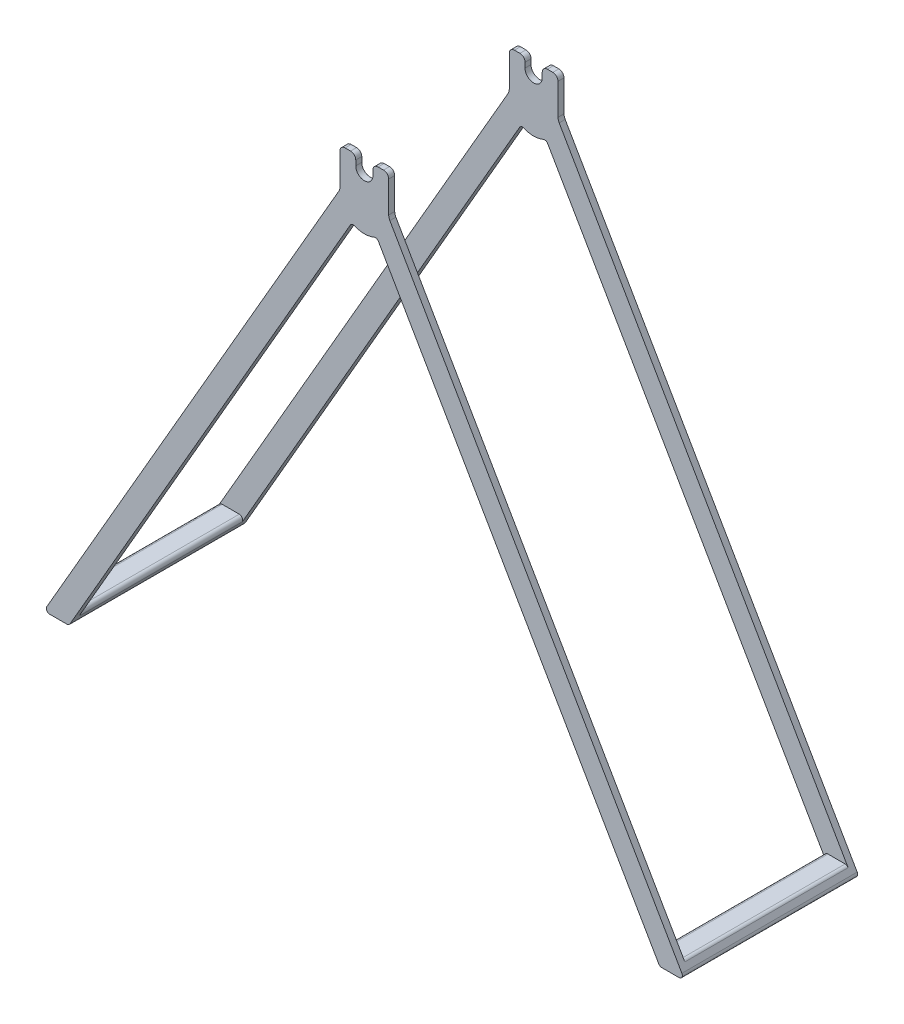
ISO-10303-21;
HEADER;
FILE_DESCRIPTION(('STEP AP214'),'2;1');
FILE_NAME('part.step','',(''),(''),'','','');
FILE_SCHEMA(('AUTOMOTIVE_DESIGN { 1 0 10303 214 1 1 1 1 }'));
ENDSEC;
DATA;
#1=APPLICATION_CONTEXT('core data for automotive mechanical design processes');
#2=APPLICATION_PROTOCOL_DEFINITION('international standard','automotive_design',2000,#1);
#3=PRODUCT_CONTEXT('',#1,'mechanical');
#4=PRODUCT('Part','Part','',(#3));
#5=PRODUCT_RELATED_PRODUCT_CATEGORY('part','',(#4));
#6=PRODUCT_DEFINITION_FORMATION('','',#4);
#7=PRODUCT_DEFINITION_CONTEXT('part definition',#1,'design');
#8=PRODUCT_DEFINITION('design','',#6,#7);
#9=PRODUCT_DEFINITION_SHAPE('','',#8);
#10=(LENGTH_UNIT() NAMED_UNIT(*) SI_UNIT(.MILLI.,.METRE.));
#11=(NAMED_UNIT(*) PLANE_ANGLE_UNIT() SI_UNIT($,.RADIAN.));
#12=(NAMED_UNIT(*) SI_UNIT($,.STERADIAN.) SOLID_ANGLE_UNIT());
#13=UNCERTAINTY_MEASURE_WITH_UNIT(LENGTH_MEASURE(1.E-05),#10,'distance_accuracy_value','');
#14=(GEOMETRIC_REPRESENTATION_CONTEXT(3) GLOBAL_UNCERTAINTY_ASSIGNED_CONTEXT((#13)) GLOBAL_UNIT_ASSIGNED_CONTEXT((#10,
#11,#12)) REPRESENTATION_CONTEXT('',''));
#15=CARTESIAN_POINT('',(0.,0.,0.));
#16=DIRECTION('',(0.,0.,1.));
#17=DIRECTION('',(1.,0.,0.));
#18=AXIS2_PLACEMENT_3D('',#15,#16,#17);
#19=CARTESIAN_POINT('',(-173.038683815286,-189.685709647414,3.5));
#20=DIRECTION('',(0.,0.,-1.));
#21=DIRECTION('',(-1.,0.,0.));
#22=AXIS2_PLACEMENT_3D('',#19,#20,#21);
#23=CYLINDRICAL_SURFACE('',#22,2.00000000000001);
#24=CARTESIAN_POINT('',(-173.038683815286,-189.685709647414,0.));
#25=DIRECTION('',(0.,0.,1.));
#26=DIRECTION('',(1.,0.,0.));
#27=AXIS2_PLACEMENT_3D('',#24,#25,#26);
#28=CIRCLE('',#27,2.00000000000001);
#29=CARTESIAN_POINT('',(-173.038683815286,-191.685709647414,0.));
#30=VERTEX_POINT('',#29);
#31=CARTESIAN_POINT('',(-171.306633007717,-190.685709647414,0.));
#32=VERTEX_POINT('',#31);
#33=EDGE_CURVE('E527',#30,#32,#28,.T.);
#34=ORIENTED_EDGE('',*,*,#33,.T.);
#35=DIRECTION('',(0.,0.,-1.));
#36=VECTOR('',#35,1.);
#37=CARTESIAN_POINT('',(-171.306633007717,-190.685709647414,3.5));
#38=LINE('',#37,#36);
#39=CARTESIAN_POINT('',(-171.306633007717,-190.685709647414,102.));
#40=VERTEX_POINT('',#39);
#41=EDGE_CURVE('E11',#40,#32,#38,.T.);
#42=ORIENTED_EDGE('',*,*,#41,.F.);
#43=CARTESIAN_POINT('',(-173.038683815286,-189.685709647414,102.));
#44=DIRECTION('',(0.,0.,1.));
#45=DIRECTION('',(1.,0.,0.));
#46=AXIS2_PLACEMENT_3D('',#43,#44,#45);
#47=CIRCLE('',#46,2.00000000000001);
#48=CARTESIAN_POINT('',(-173.038683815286,-191.685709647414,102.));
#49=VERTEX_POINT('',#48);
#50=EDGE_CURVE('E390',#49,#40,#47,.T.);
#51=ORIENTED_EDGE('',*,*,#50,.F.);
#52=DIRECTION('',(0.,0.,-1.));
#53=VECTOR('',#52,1.);
#54=CARTESIAN_POINT('',(-173.038683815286,-191.685709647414,3.5));
#55=LINE('',#54,#53);
#56=EDGE_CURVE('E591',#49,#30,#55,.T.);
#57=ORIENTED_EDGE('',*,*,#56,.T.);
#58=EDGE_LOOP('',(#34,#42,#51,#57));
#59=FACE_BOUND('',#58,.T.);
#60=ADVANCED_FACE('F33',(#59),#23,.T.);
#61=CARTESIAN_POINT('',(-171.306633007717,-190.685709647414,3.5));
#62=DIRECTION('',(-0.866025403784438,0.500000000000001,0.));
#63=DIRECTION('',(-0.500000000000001,-0.866025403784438,0.));
#64=AXIS2_PLACEMENT_3D('',#61,#62,#63);
#65=PLANE('',#64);
#66=DIRECTION('',(0.500000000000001,0.866025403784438,0.));
#67=VECTOR('',#66,1.);
#68=CARTESIAN_POINT('',(-171.306633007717,-190.685709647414,0.));
#69=LINE('',#68,#67);
#70=CARTESIAN_POINT('',(-8.17700061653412,91.8631018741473,0.));
#71=VERTEX_POINT('',#70);
#72=EDGE_CURVE('E594',#32,#71,#69,.T.);
#73=ORIENTED_EDGE('',*,*,#72,.T.);
#74=DIRECTION('',(0.,0.,-1.));
#75=VECTOR('',#74,1.);
#76=CARTESIAN_POINT('',(-8.17700061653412,91.8631018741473,3.5));
#77=LINE('',#76,#75);
#78=CARTESIAN_POINT('',(-8.17700061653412,91.8631018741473,3.5));
#79=VERTEX_POINT('',#78);
#80=EDGE_CURVE('E40',#79,#71,#77,.T.);
#81=ORIENTED_EDGE('',*,*,#80,.F.);
#82=DIRECTION('',(0.500000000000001,0.866025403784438,0.));
#83=VECTOR('',#82,1.);
#84=CARTESIAN_POINT('',(-171.306633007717,-190.685709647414,3.5));
#85=LINE('',#84,#83);
#86=CARTESIAN_POINT('',(-169.524833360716,-187.5995421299,3.5));
#87=VERTEX_POINT('',#86);
#88=EDGE_CURVE('E541',#87,#79,#85,.T.);
#89=ORIENTED_EDGE('',*,*,#88,.F.);
#90=DIRECTION('',(0.,0.,-1.));
#91=VECTOR('',#90,1.);
#92=CARTESIAN_POINT('',(-169.524833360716,-187.5995421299,102.002));
#93=LINE('',#92,#91);
#94=CARTESIAN_POINT('',(-169.524833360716,-187.5995421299,98.5));
#95=VERTEX_POINT('',#94);
#96=EDGE_CURVE('E737',#95,#87,#93,.T.);
#97=ORIENTED_EDGE('',*,*,#96,.F.);
#98=DIRECTION('',(0.500000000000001,0.866025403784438,0.));
#99=VECTOR('',#98,1.);
#100=CARTESIAN_POINT('',(-171.306633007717,-190.685709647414,98.5));
#101=LINE('',#100,#99);
#102=CARTESIAN_POINT('',(-8.17700061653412,91.8631018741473,98.5));
#103=VERTEX_POINT('',#102);
#104=EDGE_CURVE('E458',#95,#103,#101,.T.);
#105=ORIENTED_EDGE('',*,*,#104,.T.);
#106=DIRECTION('',(0.,0.,1.));
#107=VECTOR('',#106,1.);
#108=CARTESIAN_POINT('',(-8.17700061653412,91.8631018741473,98.5));
#109=LINE('',#108,#107);
#110=CARTESIAN_POINT('',(-8.17700061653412,91.8631018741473,102.));
#111=VERTEX_POINT('',#110);
#112=EDGE_CURVE('E507',#103,#111,#109,.T.);
#113=ORIENTED_EDGE('',*,*,#112,.T.);
#114=DIRECTION('',(0.500000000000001,0.866025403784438,0.));
#115=VECTOR('',#114,1.);
#116=CARTESIAN_POINT('',(-171.306633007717,-190.685709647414,102.));
#117=LINE('',#116,#115);
#118=EDGE_CURVE('E393',#40,#111,#117,.T.);
#119=ORIENTED_EDGE('',*,*,#118,.F.);
#120=ORIENTED_EDGE('',*,*,#41,.T.);
#121=EDGE_LOOP('',(#73,#81,#89,#97,#105,#113,#119,#120));
#122=FACE_BOUND('',#121,.T.);
#123=ADVANCED_FACE('F736',(#122),#65,.F.);
#124=CARTESIAN_POINT('',(-6.44494980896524,90.8631018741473,3.5));
#125=DIRECTION('',(0.,0.,-1.));
#126=DIRECTION('',(-1.,0.,0.));
#127=AXIS2_PLACEMENT_3D('',#124,#125,#126);
#128=CYLINDRICAL_SURFACE('',#127,2.);
#129=CARTESIAN_POINT('',(-6.44494980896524,90.8631018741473,0.));
#130=DIRECTION('',(0.,0.,-1.));
#131=DIRECTION('',(-1.,0.,0.));
#132=AXIS2_PLACEMENT_3D('',#129,#130,#131);
#133=CIRCLE('',#132,2.);
#134=CARTESIAN_POINT('',(-5.66259829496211,92.7037338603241,0.));
#135=VERTEX_POINT('',#134);
#136=EDGE_CURVE('E596',#71,#135,#133,.T.);
#137=ORIENTED_EDGE('',*,*,#136,.T.);
#138=DIRECTION('',(0.,0.,-1.));
#139=VECTOR('',#138,1.);
#140=CARTESIAN_POINT('',(-5.66259829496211,92.7037338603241,3.5));
#141=LINE('',#140,#139);
#142=CARTESIAN_POINT('',(-5.66259829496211,92.7037338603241,3.5));
#143=VERTEX_POINT('',#142);
#144=EDGE_CURVE('E711',#143,#135,#141,.T.);
#145=ORIENTED_EDGE('',*,*,#144,.F.);
#146=CARTESIAN_POINT('',(-6.44494980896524,90.8631018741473,3.5));
#147=DIRECTION('',(0.,0.,-1.));
#148=DIRECTION('',(-1.,0.,0.));
#149=AXIS2_PLACEMENT_3D('',#146,#147,#148);
#150=CIRCLE('',#149,2.);
#151=EDGE_CURVE('E543',#79,#143,#150,.T.);
#152=ORIENTED_EDGE('',*,*,#151,.F.);
#153=ORIENTED_EDGE('',*,*,#80,.T.);
#154=EDGE_LOOP('',(#137,#145,#152,#153));
#155=FACE_BOUND('',#154,.T.);
#156=ADVANCED_FACE('F718',(#155),#128,.F.);
#157=CARTESIAN_POINT('',(0.,106.026082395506,3.5));
#158=DIRECTION('',(0.,0.,-1.));
#159=DIRECTION('',(-1.,0.,0.));
#160=AXIS2_PLACEMENT_3D('',#157,#158,#159);
#161=CYLINDRICAL_SURFACE('',#160,14.4758415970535);
#162=CARTESIAN_POINT('',(0.,106.026082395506,0.));
#163=DIRECTION('',(0.,0.,1.));
#164=DIRECTION('',(1.,0.,0.));
#165=AXIS2_PLACEMENT_3D('',#162,#163,#164);
#166=CIRCLE('',#165,14.4758415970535);
#167=CARTESIAN_POINT('',(5.66259829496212,92.7037338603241,0.));
#168=VERTEX_POINT('',#167);
#169=EDGE_CURVE('E598',#135,#168,#166,.T.);
#170=ORIENTED_EDGE('',*,*,#169,.T.);
#171=DIRECTION('',(0.,0.,-1.));
#172=VECTOR('',#171,1.);
#173=CARTESIAN_POINT('',(5.66259829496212,92.7037338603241,3.5));
#174=LINE('',#173,#172);
#175=CARTESIAN_POINT('',(5.66259829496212,92.7037338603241,3.5));
#176=VERTEX_POINT('',#175);
#177=EDGE_CURVE('E709',#176,#168,#174,.T.);
#178=ORIENTED_EDGE('',*,*,#177,.F.);
#179=CARTESIAN_POINT('',(0.,106.026082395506,3.5));
#180=DIRECTION('',(0.,0.,1.));
#181=DIRECTION('',(1.,0.,0.));
#182=AXIS2_PLACEMENT_3D('',#179,#180,#181);
#183=CIRCLE('',#182,14.4758415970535);
#184=EDGE_CURVE('E546',#143,#176,#183,.T.);
#185=ORIENTED_EDGE('',*,*,#184,.F.);
#186=ORIENTED_EDGE('',*,*,#144,.T.);
#187=EDGE_LOOP('',(#170,#178,#185,#186));
#188=FACE_BOUND('',#187,.T.);
#189=ADVANCED_FACE('F729',(#188),#161,.T.);
#190=CARTESIAN_POINT('',(6.44494980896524,90.8631018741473,3.5));
#191=DIRECTION('',(0.,0.,-1.));
#192=DIRECTION('',(-1.,0.,0.));
#193=AXIS2_PLACEMENT_3D('',#190,#191,#192);
#194=CYLINDRICAL_SURFACE('',#193,2.);
#195=CARTESIAN_POINT('',(6.44494980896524,90.8631018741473,0.));
#196=DIRECTION('',(0.,0.,1.));
#197=DIRECTION('',(1.,0.,0.));
#198=AXIS2_PLACEMENT_3D('',#195,#196,#197);
#199=CIRCLE('',#198,2.);
#200=CARTESIAN_POINT('',(8.17700061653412,91.8631018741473,0.));
#201=VERTEX_POINT('',#200);
#202=EDGE_CURVE('E601',#201,#168,#199,.T.);
#203=ORIENTED_EDGE('',*,*,#202,.F.);
#204=DIRECTION('',(0.,0.,-1.));
#205=VECTOR('',#204,1.);
#206=CARTESIAN_POINT('',(8.17700061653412,91.8631018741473,3.5));
#207=LINE('',#206,#205);
#208=CARTESIAN_POINT('',(8.17700061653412,91.8631018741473,3.5));
#209=VERTEX_POINT('',#208);
#210=EDGE_CURVE('E707',#209,#201,#207,.T.);
#211=ORIENTED_EDGE('',*,*,#210,.F.);
#212=CARTESIAN_POINT('',(6.44494980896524,90.8631018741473,3.5));
#213=DIRECTION('',(0.,0.,1.));
#214=DIRECTION('',(1.,0.,0.));
#215=AXIS2_PLACEMENT_3D('',#212,#213,#214);
#216=CIRCLE('',#215,2.);
#217=EDGE_CURVE('E548',#209,#176,#216,.T.);
#218=ORIENTED_EDGE('',*,*,#217,.T.);
#219=ORIENTED_EDGE('',*,*,#177,.T.);
#220=EDGE_LOOP('',(#203,#211,#218,#219));
#221=FACE_BOUND('',#220,.T.);
#222=ADVANCED_FACE('F966',(#221),#194,.F.);
#223=CARTESIAN_POINT('',(171.306633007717,-190.685709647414,3.5));
#224=DIRECTION('',(-0.866025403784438,-0.500000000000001,0.));
#225=DIRECTION('',(0.500000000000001,-0.866025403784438,0.));
#226=AXIS2_PLACEMENT_3D('',#223,#224,#225);
#227=PLANE('',#226);
#228=DIRECTION('',(-0.500000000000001,0.866025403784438,0.));
#229=VECTOR('',#228,1.);
#230=CARTESIAN_POINT('',(171.306633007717,-190.685709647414,0.));
#231=LINE('',#230,#229);
#232=CARTESIAN_POINT('',(171.306633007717,-190.685709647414,0.));
#233=VERTEX_POINT('',#232);
#234=EDGE_CURVE('E604',#233,#201,#231,.T.);
#235=ORIENTED_EDGE('',*,*,#234,.F.);
#236=DIRECTION('',(0.,0.,-1.));
#237=VECTOR('',#236,1.);
#238=CARTESIAN_POINT('',(171.306633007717,-190.685709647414,3.5));
#239=LINE('',#238,#237);
#240=CARTESIAN_POINT('',(171.306633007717,-190.685709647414,102.));
#241=VERTEX_POINT('',#240);
#242=EDGE_CURVE('E705',#241,#233,#239,.T.);
#243=ORIENTED_EDGE('',*,*,#242,.F.);
#244=DIRECTION('',(-0.500000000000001,0.866025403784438,0.));
#245=VECTOR('',#244,1.);
#246=CARTESIAN_POINT('',(171.306633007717,-190.685709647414,102.));
#247=LINE('',#246,#245);
#248=CARTESIAN_POINT('',(8.17700061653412,91.8631018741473,102.));
#249=VERTEX_POINT('',#248);
#250=EDGE_CURVE('E404',#241,#249,#247,.T.);
#251=ORIENTED_EDGE('',*,*,#250,.T.);
#252=DIRECTION('',(0.,0.,1.));
#253=VECTOR('',#252,1.);
#254=CARTESIAN_POINT('',(8.17700061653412,91.8631018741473,98.5));
#255=LINE('',#254,#253);
#256=CARTESIAN_POINT('',(8.17700061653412,91.8631018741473,98.5));
#257=VERTEX_POINT('',#256);
#258=EDGE_CURVE('E498',#257,#249,#255,.T.);
#259=ORIENTED_EDGE('',*,*,#258,.F.);
#260=DIRECTION('',(-0.500000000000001,0.866025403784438,0.));
#261=VECTOR('',#260,1.);
#262=CARTESIAN_POINT('',(171.306633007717,-190.685709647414,98.5));
#263=LINE('',#262,#261);
#264=CARTESIAN_POINT('',(169.524833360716,-187.5995421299,98.5));
#265=VERTEX_POINT('',#264);
#266=EDGE_CURVE('E761',#265,#257,#263,.T.);
#267=ORIENTED_EDGE('',*,*,#266,.F.);
#268=DIRECTION('',(0.,0.,-1.));
#269=VECTOR('',#268,1.);
#270=CARTESIAN_POINT('',(169.524833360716,-187.5995421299,102.002));
#271=LINE('',#270,#269);
#272=CARTESIAN_POINT('',(169.524833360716,-187.5995421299,3.5));
#273=VERTEX_POINT('',#272);
#274=EDGE_CURVE('E530',#265,#273,#271,.T.);
#275=ORIENTED_EDGE('',*,*,#274,.T.);
#276=DIRECTION('',(-0.500000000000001,0.866025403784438,0.));
#277=VECTOR('',#276,1.);
#278=CARTESIAN_POINT('',(171.306633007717,-190.685709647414,3.5));
#279=LINE('',#278,#277);
#280=EDGE_CURVE('E551',#273,#209,#279,.T.);
#281=ORIENTED_EDGE('',*,*,#280,.T.);
#282=ORIENTED_EDGE('',*,*,#210,.T.);
#283=EDGE_LOOP('',(#235,#243,#251,#259,#267,#275,#281,#282));
#284=FACE_BOUND('',#283,.T.);
#285=ADVANCED_FACE('F861',(#284),#227,.T.);
#286=CARTESIAN_POINT('',(173.038683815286,-189.685709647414,3.5));
#287=DIRECTION('',(0.,0.,-1.));
#288=DIRECTION('',(-1.,0.,0.));
#289=AXIS2_PLACEMENT_3D('',#286,#287,#288);
#290=CYLINDRICAL_SURFACE('',#289,2.);
#291=CARTESIAN_POINT('',(173.038683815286,-189.685709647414,0.));
#292=DIRECTION('',(0.,0.,-1.));
#293=DIRECTION('',(-1.,0.,0.));
#294=AXIS2_PLACEMENT_3D('',#291,#292,#293);
#295=CIRCLE('',#294,2.);
#296=CARTESIAN_POINT('',(173.038683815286,-191.685709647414,0.));
#297=VERTEX_POINT('',#296);
#298=EDGE_CURVE('E607',#297,#233,#295,.T.);
#299=ORIENTED_EDGE('',*,*,#298,.F.);
#300=DIRECTION('',(0.,0.,-1.));
#301=VECTOR('',#300,1.);
#302=CARTESIAN_POINT('',(173.038683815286,-191.685709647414,3.5));
#303=LINE('',#302,#301);
#304=CARTESIAN_POINT('',(173.038683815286,-191.685709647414,102.));
#305=VERTEX_POINT('',#304);
#306=EDGE_CURVE('E703',#305,#297,#303,.T.);
#307=ORIENTED_EDGE('',*,*,#306,.F.);
#308=CARTESIAN_POINT('',(173.038683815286,-189.685709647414,102.));
#309=DIRECTION('',(0.,0.,-1.));
#310=DIRECTION('',(-1.,0.,0.));
#311=AXIS2_PLACEMENT_3D('',#308,#309,#310);
#312=CIRCLE('',#311,2.);
#313=EDGE_CURVE('E406',#305,#241,#312,.T.);
#314=ORIENTED_EDGE('',*,*,#313,.T.);
#315=ORIENTED_EDGE('',*,*,#242,.T.);
#316=EDGE_LOOP('',(#299,#307,#314,#315));
#317=FACE_BOUND('',#316,.T.);
#318=ADVANCED_FACE('F972',(#317),#290,.T.);
#319=CARTESIAN_POINT('',(183.038683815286,-191.685709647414,3.5));
#320=DIRECTION('',(0.,-1.,0.));
#321=DIRECTION('',(0.,0.,-1.));
#322=AXIS2_PLACEMENT_3D('',#319,#320,#321);
#323=PLANE('',#322);
#324=DIRECTION('',(-1.,0.,0.));
#325=VECTOR('',#324,1.);
#326=CARTESIAN_POINT('',(183.038683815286,-191.685709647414,0.));
#327=LINE('',#326,#325);
#328=CARTESIAN_POINT('',(183.038683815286,-191.685709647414,0.));
#329=VERTEX_POINT('',#328);
#330=EDGE_CURVE('E610',#329,#297,#327,.T.);
#331=ORIENTED_EDGE('',*,*,#330,.F.);
#332=DIRECTION('',(0.,0.,-1.));
#333=VECTOR('',#332,1.);
#334=CARTESIAN_POINT('',(183.038683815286,-191.685709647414,3.5));
#335=LINE('',#334,#333);
#336=CARTESIAN_POINT('',(183.038683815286,-191.685709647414,102.));
#337=VERTEX_POINT('',#336);
#338=EDGE_CURVE('E701',#337,#329,#335,.T.);
#339=ORIENTED_EDGE('',*,*,#338,.F.);
#340=DIRECTION('',(-1.,0.,0.));
#341=VECTOR('',#340,1.);
#342=CARTESIAN_POINT('',(183.038683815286,-191.685709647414,102.));
#343=LINE('',#342,#341);
#344=EDGE_CURVE('E409',#337,#305,#343,.T.);
#345=ORIENTED_EDGE('',*,*,#344,.T.);
#346=ORIENTED_EDGE('',*,*,#306,.T.);
#347=EDGE_LOOP('',(#331,#339,#345,#346));
#348=FACE_BOUND('',#347,.T.);
#349=ADVANCED_FACE('F975',(#348),#323,.T.);
#350=CARTESIAN_POINT('',(183.038683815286,-189.685709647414,3.5));
#351=DIRECTION('',(0.,0.,-1.));
#352=DIRECTION('',(-1.,0.,0.));
#353=AXIS2_PLACEMENT_3D('',#350,#351,#352);
#354=CYLINDRICAL_SURFACE('',#353,1.99999999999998);
#355=CARTESIAN_POINT('',(183.038683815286,-189.685709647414,0.));
#356=DIRECTION('',(0.,0.,-1.));
#357=DIRECTION('',(-1.,0.,0.));
#358=AXIS2_PLACEMENT_3D('',#355,#356,#357);
#359=CIRCLE('',#358,1.99999999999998);
#360=CARTESIAN_POINT('',(184.770734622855,-188.685709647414,0.));
#361=VERTEX_POINT('',#360);
#362=EDGE_CURVE('E613',#361,#329,#359,.T.);
#363=ORIENTED_EDGE('',*,*,#362,.F.);
#364=DIRECTION('',(0.,0.,-1.));
#365=VECTOR('',#364,1.);
#366=CARTESIAN_POINT('',(184.770734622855,-188.685709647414,3.5));
#367=LINE('',#366,#365);
#368=CARTESIAN_POINT('',(184.770734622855,-188.685709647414,102.));
#369=VERTEX_POINT('',#368);
#370=EDGE_CURVE('E699',#369,#361,#367,.T.);
#371=ORIENTED_EDGE('',*,*,#370,.F.);
#372=CARTESIAN_POINT('',(183.038683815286,-189.685709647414,102.));
#373=DIRECTION('',(0.,0.,-1.));
#374=DIRECTION('',(-1.,0.,0.));
#375=AXIS2_PLACEMENT_3D('',#372,#373,#374);
#376=CIRCLE('',#375,1.99999999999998);
#377=EDGE_CURVE('E412',#369,#337,#376,.T.);
#378=ORIENTED_EDGE('',*,*,#377,.T.);
#379=ORIENTED_EDGE('',*,*,#338,.T.);
#380=EDGE_LOOP('',(#363,#371,#378,#379));
#381=FACE_BOUND('',#380,.T.);
#382=ADVANCED_FACE('F953',(#381),#354,.T.);
#383=CARTESIAN_POINT('',(14.8468794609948,105.631040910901,3.5));
#384=DIRECTION('',(0.866025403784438,0.500000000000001,0.));
#385=DIRECTION('',(-0.500000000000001,0.866025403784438,0.));
#386=AXIS2_PLACEMENT_3D('',#383,#384,#385);
#387=PLANE('',#386);
#388=DIRECTION('',(0.500000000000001,-0.866025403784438,0.));
#389=VECTOR('',#388,1.);
#390=CARTESIAN_POINT('',(14.8468794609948,105.631040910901,0.));
#391=LINE('',#390,#389);
#392=CARTESIAN_POINT('',(14.8468794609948,105.631040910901,0.));
#393=VERTEX_POINT('',#392);
#394=EDGE_CURVE('E616',#393,#361,#391,.T.);
#395=ORIENTED_EDGE('',*,*,#394,.F.);
#396=DIRECTION('',(0.,0.,-1.));
#397=VECTOR('',#396,1.);
#398=CARTESIAN_POINT('',(14.8468794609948,105.631040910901,3.5));
#399=LINE('',#398,#397);
#400=CARTESIAN_POINT('',(14.8468794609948,105.631040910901,3.5));
#401=VERTEX_POINT('',#400);
#402=EDGE_CURVE('E697',#401,#393,#399,.T.);
#403=ORIENTED_EDGE('',*,*,#402,.F.);
#404=DIRECTION('',(0.500000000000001,-0.866025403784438,0.));
#405=VECTOR('',#404,1.);
#406=CARTESIAN_POINT('',(14.8468794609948,105.631040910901,3.5));
#407=LINE('',#406,#405);
#408=CARTESIAN_POINT('',(182.988934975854,-185.5995421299,3.5));
#409=VERTEX_POINT('',#408);
#410=EDGE_CURVE('E553',#401,#409,#407,.T.);
#411=ORIENTED_EDGE('',*,*,#410,.T.);
#412=DIRECTION('',(0.,0.,-1.));
#413=VECTOR('',#412,1.);
#414=CARTESIAN_POINT('',(182.988934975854,-185.5995421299,102.002));
#415=LINE('',#414,#413);
#416=CARTESIAN_POINT('',(182.988934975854,-185.5995421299,98.5));
#417=VERTEX_POINT('',#416);
#418=EDGE_CURVE('E519',#417,#409,#415,.T.);
#419=ORIENTED_EDGE('',*,*,#418,.F.);
#420=DIRECTION('',(0.500000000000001,-0.866025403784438,0.));
#421=VECTOR('',#420,1.);
#422=CARTESIAN_POINT('',(14.8468794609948,105.631040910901,98.5));
#423=LINE('',#422,#421);
#424=CARTESIAN_POINT('',(14.8468794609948,105.631040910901,98.5));
#425=VERTEX_POINT('',#424);
#426=EDGE_CURVE('E763',#425,#417,#423,.T.);
#427=ORIENTED_EDGE('',*,*,#426,.F.);
#428=DIRECTION('',(0.,0.,1.));
#429=VECTOR('',#428,1.);
#430=CARTESIAN_POINT('',(14.8468794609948,105.631040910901,98.5));
#431=LINE('',#430,#429);
#432=CARTESIAN_POINT('',(14.8468794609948,105.631040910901,102.));
#433=VERTEX_POINT('',#432);
#434=EDGE_CURVE('E495',#425,#433,#431,.T.);
#435=ORIENTED_EDGE('',*,*,#434,.T.);
#436=DIRECTION('',(0.500000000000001,-0.866025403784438,0.));
#437=VECTOR('',#436,1.);
#438=CARTESIAN_POINT('',(14.8468794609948,105.631040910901,102.));
#439=LINE('',#438,#437);
#440=EDGE_CURVE('E415',#433,#369,#439,.T.);
#441=ORIENTED_EDGE('',*,*,#440,.T.);
#442=ORIENTED_EDGE('',*,*,#370,.T.);
#443=EDGE_LOOP('',(#395,#403,#411,#419,#427,#435,#441,#442));
#444=FACE_BOUND('',#443,.T.);
#445=ADVANCED_FACE('F848',(#444),#387,.T.);
#446=CARTESIAN_POINT('',(19.177006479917,108.131040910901,3.5));
#447=DIRECTION('',(0.,0.,-1.));
#448=DIRECTION('',(-1.,0.,0.));
#449=AXIS2_PLACEMENT_3D('',#446,#447,#448);
#450=CYLINDRICAL_SURFACE('',#449,5.);
#451=CARTESIAN_POINT('',(19.177006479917,108.131040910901,0.));
#452=DIRECTION('',(0.,0.,-1.));
#453=DIRECTION('',(-1.,0.,0.));
#454=AXIS2_PLACEMENT_3D('',#451,#452,#453);
#455=CIRCLE('',#454,5.);
#456=CARTESIAN_POINT('',(14.177006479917,108.131040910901,0.));
#457=VERTEX_POINT('',#456);
#458=EDGE_CURVE('E619',#393,#457,#455,.T.);
#459=ORIENTED_EDGE('',*,*,#458,.T.);
#460=DIRECTION('',(0.,0.,-1.));
#461=VECTOR('',#460,1.);
#462=CARTESIAN_POINT('',(14.177006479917,108.131040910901,3.5));
#463=LINE('',#462,#461);
#464=CARTESIAN_POINT('',(14.177006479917,108.131040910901,3.5));
#465=VERTEX_POINT('',#464);
#466=EDGE_CURVE('E694',#465,#457,#463,.T.);
#467=ORIENTED_EDGE('',*,*,#466,.F.);
#468=CARTESIAN_POINT('',(19.177006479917,108.131040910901,3.5));
#469=DIRECTION('',(0.,0.,-1.));
#470=DIRECTION('',(-1.,0.,0.));
#471=AXIS2_PLACEMENT_3D('',#468,#469,#470);
#472=CIRCLE('',#471,5.);
#473=EDGE_CURVE('E556',#401,#465,#472,.T.);
#474=ORIENTED_EDGE('',*,*,#473,.F.);
#475=ORIENTED_EDGE('',*,*,#402,.T.);
#476=EDGE_LOOP('',(#459,#467,#474,#475));
#477=FACE_BOUND('',#476,.T.);
#478=ADVANCED_FACE('F945',(#477),#450,.F.);
#479=CARTESIAN_POINT('',(14.177006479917,108.131040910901,3.5));
#480=DIRECTION('',(-1.,0.,0.));
#481=DIRECTION('',(0.,0.,1.));
#482=AXIS2_PLACEMENT_3D('',#479,#480,#481);
#483=PLANE('',#482);
#484=DIRECTION('',(0.,1.,0.));
#485=VECTOR('',#484,1.);
#486=CARTESIAN_POINT('',(14.177006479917,108.131040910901,0.));
#487=LINE('',#486,#485);
#488=CARTESIAN_POINT('',(14.177006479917,126.259507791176,0.));
#489=VERTEX_POINT('',#488);
#490=EDGE_CURVE('E621',#457,#489,#487,.T.);
#491=ORIENTED_EDGE('',*,*,#490,.T.);
#492=DIRECTION('',(0.,0.,-1.));
#493=VECTOR('',#492,1.);
#494=CARTESIAN_POINT('',(14.177006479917,126.259507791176,3.5));
#495=LINE('',#494,#493);
#496=CARTESIAN_POINT('',(14.177006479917,126.259507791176,3.5));
#497=VERTEX_POINT('',#496);
#498=EDGE_CURVE('E691',#497,#489,#495,.T.);
#499=ORIENTED_EDGE('',*,*,#498,.F.);
#500=DIRECTION('',(0.,1.,0.));
#501=VECTOR('',#500,1.);
#502=CARTESIAN_POINT('',(14.177006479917,108.131040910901,3.5));
#503=LINE('',#502,#501);
#504=EDGE_CURVE('E558',#465,#497,#503,.T.);
#505=ORIENTED_EDGE('',*,*,#504,.F.);
#506=ORIENTED_EDGE('',*,*,#466,.T.);
#507=EDGE_LOOP('',(#491,#499,#505,#506));
#508=FACE_BOUND('',#507,.T.);
#509=ADVANCED_FACE('F942',(#508),#483,.F.);
#510=CARTESIAN_POINT('',(11.177006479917,126.259507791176,3.5));
#511=DIRECTION('',(0.,0.,-1.));
#512=DIRECTION('',(-1.,0.,0.));
#513=AXIS2_PLACEMENT_3D('',#510,#511,#512);
#514=CYLINDRICAL_SURFACE('',#513,3.);
#515=CARTESIAN_POINT('',(11.177006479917,126.259507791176,0.));
#516=DIRECTION('',(0.,0.,1.));
#517=DIRECTION('',(1.,0.,0.));
#518=AXIS2_PLACEMENT_3D('',#515,#516,#517);
#519=CIRCLE('',#518,3.);
#520=CARTESIAN_POINT('',(11.177006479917,129.259507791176,0.));
#521=VERTEX_POINT('',#520);
#522=EDGE_CURVE('E623',#489,#521,#519,.T.);
#523=ORIENTED_EDGE('',*,*,#522,.T.);
#524=DIRECTION('',(0.,0.,-1.));
#525=VECTOR('',#524,1.);
#526=CARTESIAN_POINT('',(11.177006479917,129.259507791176,3.5));
#527=LINE('',#526,#525);
#528=CARTESIAN_POINT('',(11.177006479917,129.259507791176,3.5));
#529=VERTEX_POINT('',#528);
#530=EDGE_CURVE('E688',#529,#521,#527,.T.);
#531=ORIENTED_EDGE('',*,*,#530,.F.);
#532=CARTESIAN_POINT('',(11.177006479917,126.259507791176,3.5));
#533=DIRECTION('',(0.,0.,1.));
#534=DIRECTION('',(1.,0.,0.));
#535=AXIS2_PLACEMENT_3D('',#532,#533,#534);
#536=CIRCLE('',#535,3.);
#537=EDGE_CURVE('E560',#497,#529,#536,.T.);
#538=ORIENTED_EDGE('',*,*,#537,.F.);
#539=ORIENTED_EDGE('',*,*,#498,.T.);
#540=EDGE_LOOP('',(#523,#531,#538,#539));
#541=FACE_BOUND('',#540,.T.);
#542=ADVANCED_FACE('F937',(#541),#514,.T.);
#543=CARTESIAN_POINT('',(11.177006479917,129.259507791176,3.5));
#544=DIRECTION('',(0.,-1.,0.));
#545=DIRECTION('',(0.,0.,-1.));
#546=AXIS2_PLACEMENT_3D('',#543,#544,#545);
#547=PLANE('',#546);
#548=DIRECTION('',(-1.,0.,0.));
#549=VECTOR('',#548,1.);
#550=CARTESIAN_POINT('',(11.177006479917,129.259507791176,0.));
#551=LINE('',#550,#549);
#552=CARTESIAN_POINT('',(8.,129.259507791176,0.));
#553=VERTEX_POINT('',#552);
#554=EDGE_CURVE('E625',#521,#553,#551,.T.);
#555=ORIENTED_EDGE('',*,*,#554,.T.);
#556=DIRECTION('',(0.,0.,-1.));
#557=VECTOR('',#556,1.);
#558=CARTESIAN_POINT('',(8.,129.259507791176,3.5));
#559=LINE('',#558,#557);
#560=CARTESIAN_POINT('',(8.,129.259507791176,3.5));
#561=VERTEX_POINT('',#560);
#562=EDGE_CURVE('E685',#561,#553,#559,.T.);
#563=ORIENTED_EDGE('',*,*,#562,.F.);
#564=DIRECTION('',(-1.,0.,0.));
#565=VECTOR('',#564,1.);
#566=CARTESIAN_POINT('',(11.177006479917,129.259507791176,3.5));
#567=LINE('',#566,#565);
#568=EDGE_CURVE('E562',#529,#561,#567,.T.);
#569=ORIENTED_EDGE('',*,*,#568,.F.);
#570=ORIENTED_EDGE('',*,*,#530,.T.);
#571=EDGE_LOOP('',(#555,#563,#569,#570));
#572=FACE_BOUND('',#571,.T.);
#573=ADVANCED_FACE('F933',(#572),#547,.F.);
#574=CARTESIAN_POINT('',(8.,126.259507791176,3.5));
#575=DIRECTION('',(0.,0.,-1.));
#576=DIRECTION('',(-1.,0.,0.));
#577=AXIS2_PLACEMENT_3D('',#574,#575,#576);
#578=CYLINDRICAL_SURFACE('',#577,3.);
#579=CARTESIAN_POINT('',(8.,126.259507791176,0.));
#580=DIRECTION('',(0.,0.,1.));
#581=DIRECTION('',(1.,0.,0.));
#582=AXIS2_PLACEMENT_3D('',#579,#580,#581);
#583=CIRCLE('',#582,3.);
#584=CARTESIAN_POINT('',(5.,126.259507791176,0.));
#585=VERTEX_POINT('',#584);
#586=EDGE_CURVE('E627',#553,#585,#583,.T.);
#587=ORIENTED_EDGE('',*,*,#586,.T.);
#588=DIRECTION('',(0.,0.,-1.));
#589=VECTOR('',#588,1.);
#590=CARTESIAN_POINT('',(5.,126.259507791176,3.5));
#591=LINE('',#590,#589);
#592=CARTESIAN_POINT('',(5.,126.259507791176,3.5));
#593=VERTEX_POINT('',#592);
#594=EDGE_CURVE('E682',#593,#585,#591,.T.);
#595=ORIENTED_EDGE('',*,*,#594,.F.);
#596=CARTESIAN_POINT('',(8.,126.259507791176,3.5));
#597=DIRECTION('',(0.,0.,1.));
#598=DIRECTION('',(1.,0.,0.));
#599=AXIS2_PLACEMENT_3D('',#596,#597,#598);
#600=CIRCLE('',#599,3.);
#601=EDGE_CURVE('E564',#561,#593,#600,.T.);
#602=ORIENTED_EDGE('',*,*,#601,.F.);
#603=ORIENTED_EDGE('',*,*,#562,.T.);
#604=EDGE_LOOP('',(#587,#595,#602,#603));
#605=FACE_BOUND('',#604,.T.);
#606=ADVANCED_FACE('F928',(#605),#578,.T.);
#607=CARTESIAN_POINT('',(5.,126.259507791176,3.5));
#608=DIRECTION('',(1.,0.,0.));
#609=DIRECTION('',(0.,0.,-1.));
#610=AXIS2_PLACEMENT_3D('',#607,#608,#609);
#611=PLANE('',#610);
#612=DIRECTION('',(0.,-1.,0.));
#613=VECTOR('',#612,1.);
#614=CARTESIAN_POINT('',(5.,126.259507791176,0.));
#615=LINE('',#614,#613);
#616=CARTESIAN_POINT('',(5.,123.314290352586,0.));
#617=VERTEX_POINT('',#616);
#618=EDGE_CURVE('E629',#585,#617,#615,.T.);
#619=ORIENTED_EDGE('',*,*,#618,.T.);
#620=DIRECTION('',(0.,0.,-1.));
#621=VECTOR('',#620,1.);
#622=CARTESIAN_POINT('',(5.,123.314290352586,3.5));
#623=LINE('',#622,#621);
#624=CARTESIAN_POINT('',(5.,123.314290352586,3.5));
#625=VERTEX_POINT('',#624);
#626=EDGE_CURVE('E680',#625,#617,#623,.T.);
#627=ORIENTED_EDGE('',*,*,#626,.F.);
#628=DIRECTION('',(0.,-1.,0.));
#629=VECTOR('',#628,1.);
#630=CARTESIAN_POINT('',(5.,126.259507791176,3.5));
#631=LINE('',#630,#629);
#632=EDGE_CURVE('E566',#593,#625,#631,.T.);
#633=ORIENTED_EDGE('',*,*,#632,.F.);
#634=ORIENTED_EDGE('',*,*,#594,.T.);
#635=EDGE_LOOP('',(#619,#627,#633,#634));
#636=FACE_BOUND('',#635,.T.);
#637=ADVANCED_FACE('F922',(#636),#611,.F.);
#638=CARTESIAN_POINT('',(0.,123.314290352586,3.5));
#639=DIRECTION('',(0.,0.,-1.));
#640=DIRECTION('',(-1.,0.,0.));
#641=AXIS2_PLACEMENT_3D('',#638,#639,#640);
#642=CYLINDRICAL_SURFACE('',#641,5.);
#643=CARTESIAN_POINT('',(0.,123.314290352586,0.));
#644=DIRECTION('',(0.,0.,1.));
#645=DIRECTION('',(1.,0.,0.));
#646=AXIS2_PLACEMENT_3D('',#643,#644,#645);
#647=CIRCLE('',#646,5.);
#648=CARTESIAN_POINT('',(-5.,123.314290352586,0.));
#649=VERTEX_POINT('',#648);
#650=EDGE_CURVE('E632',#649,#617,#647,.T.);
#651=ORIENTED_EDGE('',*,*,#650,.F.);
#652=DIRECTION('',(0.,0.,-1.));
#653=VECTOR('',#652,1.);
#654=CARTESIAN_POINT('',(-5.,123.314290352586,3.5));
#655=LINE('',#654,#653);
#656=CARTESIAN_POINT('',(-5.,123.314290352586,3.5));
#657=VERTEX_POINT('',#656);
#658=EDGE_CURVE('E678',#657,#649,#655,.T.);
#659=ORIENTED_EDGE('',*,*,#658,.F.);
#660=CARTESIAN_POINT('',(0.,123.314290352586,3.5));
#661=DIRECTION('',(0.,0.,1.));
#662=DIRECTION('',(1.,0.,0.));
#663=AXIS2_PLACEMENT_3D('',#660,#661,#662);
#664=CIRCLE('',#663,5.);
#665=EDGE_CURVE('E568',#657,#625,#664,.T.);
#666=ORIENTED_EDGE('',*,*,#665,.T.);
#667=ORIENTED_EDGE('',*,*,#626,.T.);
#668=EDGE_LOOP('',(#651,#659,#666,#667));
#669=FACE_BOUND('',#668,.T.);
#670=ADVANCED_FACE('F918',(#669),#642,.F.);
#671=CARTESIAN_POINT('',(-5.,126.259507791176,3.5));
#672=DIRECTION('',(1.,0.,0.));
#673=DIRECTION('',(0.,0.,-1.));
#674=AXIS2_PLACEMENT_3D('',#671,#672,#673);
#675=PLANE('',#674);
#676=DIRECTION('',(0.,-1.,0.));
#677=VECTOR('',#676,1.);
#678=CARTESIAN_POINT('',(-5.,126.259507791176,0.));
#679=LINE('',#678,#677);
#680=CARTESIAN_POINT('',(-5.,126.259507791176,0.));
#681=VERTEX_POINT('',#680);
#682=EDGE_CURVE('E635',#681,#649,#679,.T.);
#683=ORIENTED_EDGE('',*,*,#682,.F.);
#684=DIRECTION('',(0.,0.,-1.));
#685=VECTOR('',#684,1.);
#686=CARTESIAN_POINT('',(-5.,126.259507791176,3.5));
#687=LINE('',#686,#685);
#688=CARTESIAN_POINT('',(-5.,126.259507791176,3.5));
#689=VERTEX_POINT('',#688);
#690=EDGE_CURVE('E676',#689,#681,#687,.T.);
#691=ORIENTED_EDGE('',*,*,#690,.F.);
#692=DIRECTION('',(0.,-1.,0.));
#693=VECTOR('',#692,1.);
#694=CARTESIAN_POINT('',(-5.,126.259507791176,3.5));
#695=LINE('',#694,#693);
#696=EDGE_CURVE('E571',#689,#657,#695,.T.);
#697=ORIENTED_EDGE('',*,*,#696,.T.);
#698=ORIENTED_EDGE('',*,*,#658,.T.);
#699=EDGE_LOOP('',(#683,#691,#697,#698));
#700=FACE_BOUND('',#699,.T.);
#701=ADVANCED_FACE('F914',(#700),#675,.T.);
#702=CARTESIAN_POINT('',(-8.,126.259507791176,3.5));
#703=DIRECTION('',(0.,0.,-1.));
#704=DIRECTION('',(-1.,0.,0.));
#705=AXIS2_PLACEMENT_3D('',#702,#703,#704);
#706=CYLINDRICAL_SURFACE('',#705,3.);
#707=CARTESIAN_POINT('',(-8.,126.259507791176,0.));
#708=DIRECTION('',(0.,0.,-1.));
#709=DIRECTION('',(-1.,0.,0.));
#710=AXIS2_PLACEMENT_3D('',#707,#708,#709);
#711=CIRCLE('',#710,3.);
#712=CARTESIAN_POINT('',(-8.,129.259507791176,0.));
#713=VERTEX_POINT('',#712);
#714=EDGE_CURVE('E638',#713,#681,#711,.T.);
#715=ORIENTED_EDGE('',*,*,#714,.F.);
#716=DIRECTION('',(0.,0.,-1.));
#717=VECTOR('',#716,1.);
#718=CARTESIAN_POINT('',(-8.,129.259507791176,3.5));
#719=LINE('',#718,#717);
#720=CARTESIAN_POINT('',(-8.,129.259507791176,3.5));
#721=VERTEX_POINT('',#720);
#722=EDGE_CURVE('E674',#721,#713,#719,.T.);
#723=ORIENTED_EDGE('',*,*,#722,.F.);
#724=CARTESIAN_POINT('',(-8.,126.259507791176,3.5));
#725=DIRECTION('',(0.,0.,-1.));
#726=DIRECTION('',(-1.,0.,0.));
#727=AXIS2_PLACEMENT_3D('',#724,#725,#726);
#728=CIRCLE('',#727,3.);
#729=EDGE_CURVE('E574',#721,#689,#728,.T.);
#730=ORIENTED_EDGE('',*,*,#729,.T.);
#731=ORIENTED_EDGE('',*,*,#690,.T.);
#732=EDGE_LOOP('',(#715,#723,#730,#731));
#733=FACE_BOUND('',#732,.T.);
#734=ADVANCED_FACE('F909',(#733),#706,.T.);
#735=CARTESIAN_POINT('',(-11.177006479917,129.259507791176,3.5));
#736=DIRECTION('',(0.,1.,0.));
#737=DIRECTION('',(0.,0.,1.));
#738=AXIS2_PLACEMENT_3D('',#735,#736,#737);
#739=PLANE('',#738);
#740=DIRECTION('',(1.,0.,0.));
#741=VECTOR('',#740,1.);
#742=CARTESIAN_POINT('',(-11.177006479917,129.259507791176,0.));
#743=LINE('',#742,#741);
#744=CARTESIAN_POINT('',(-11.177006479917,129.259507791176,0.));
#745=VERTEX_POINT('',#744);
#746=EDGE_CURVE('E641',#745,#713,#743,.T.);
#747=ORIENTED_EDGE('',*,*,#746,.F.);
#748=DIRECTION('',(0.,0.,-1.));
#749=VECTOR('',#748,1.);
#750=CARTESIAN_POINT('',(-11.177006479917,129.259507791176,3.5));
#751=LINE('',#750,#749);
#752=CARTESIAN_POINT('',(-11.177006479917,129.259507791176,3.5));
#753=VERTEX_POINT('',#752);
#754=EDGE_CURVE('E672',#753,#745,#751,.T.);
#755=ORIENTED_EDGE('',*,*,#754,.F.);
#756=DIRECTION('',(1.,0.,0.));
#757=VECTOR('',#756,1.);
#758=CARTESIAN_POINT('',(-11.177006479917,129.259507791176,3.5));
#759=LINE('',#758,#757);
#760=EDGE_CURVE('E577',#753,#721,#759,.T.);
#761=ORIENTED_EDGE('',*,*,#760,.T.);
#762=ORIENTED_EDGE('',*,*,#722,.T.);
#763=EDGE_LOOP('',(#747,#755,#761,#762));
#764=FACE_BOUND('',#763,.T.);
#765=ADVANCED_FACE('F905',(#764),#739,.T.);
#766=CARTESIAN_POINT('',(-11.177006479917,126.259507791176,3.5));
#767=DIRECTION('',(0.,0.,-1.));
#768=DIRECTION('',(-1.,0.,0.));
#769=AXIS2_PLACEMENT_3D('',#766,#767,#768);
#770=CYLINDRICAL_SURFACE('',#769,3.);
#771=CARTESIAN_POINT('',(-11.177006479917,126.259507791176,0.));
#772=DIRECTION('',(0.,0.,-1.));
#773=DIRECTION('',(-1.,0.,0.));
#774=AXIS2_PLACEMENT_3D('',#771,#772,#773);
#775=CIRCLE('',#774,3.);
#776=CARTESIAN_POINT('',(-14.177006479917,126.259507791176,0.));
#777=VERTEX_POINT('',#776);
#778=EDGE_CURVE('E644',#777,#745,#775,.T.);
#779=ORIENTED_EDGE('',*,*,#778,.F.);
#780=DIRECTION('',(0.,0.,-1.));
#781=VECTOR('',#780,1.);
#782=CARTESIAN_POINT('',(-14.177006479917,126.259507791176,3.5));
#783=LINE('',#782,#781);
#784=CARTESIAN_POINT('',(-14.177006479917,126.259507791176,3.5));
#785=VERTEX_POINT('',#784);
#786=EDGE_CURVE('E670',#785,#777,#783,.T.);
#787=ORIENTED_EDGE('',*,*,#786,.F.);
#788=CARTESIAN_POINT('',(-11.177006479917,126.259507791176,3.5));
#789=DIRECTION('',(0.,0.,-1.));
#790=DIRECTION('',(-1.,0.,0.));
#791=AXIS2_PLACEMENT_3D('',#788,#789,#790);
#792=CIRCLE('',#791,3.);
#793=EDGE_CURVE('E580',#785,#753,#792,.T.);
#794=ORIENTED_EDGE('',*,*,#793,.T.);
#795=ORIENTED_EDGE('',*,*,#754,.T.);
#796=EDGE_LOOP('',(#779,#787,#794,#795));
#797=FACE_BOUND('',#796,.T.);
#798=ADVANCED_FACE('F901',(#797),#770,.T.);
#799=CARTESIAN_POINT('',(-14.177006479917,108.131040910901,3.5));
#800=DIRECTION('',(-1.,0.,0.));
#801=DIRECTION('',(0.,0.,1.));
#802=AXIS2_PLACEMENT_3D('',#799,#800,#801);
#803=PLANE('',#802);
#804=DIRECTION('',(0.,1.,0.));
#805=VECTOR('',#804,1.);
#806=CARTESIAN_POINT('',(-14.177006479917,108.131040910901,0.));
#807=LINE('',#806,#805);
#808=CARTESIAN_POINT('',(-14.177006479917,108.131040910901,0.));
#809=VERTEX_POINT('',#808);
#810=EDGE_CURVE('E647',#809,#777,#807,.T.);
#811=ORIENTED_EDGE('',*,*,#810,.F.);
#812=DIRECTION('',(0.,0.,-1.));
#813=VECTOR('',#812,1.);
#814=CARTESIAN_POINT('',(-14.177006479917,108.131040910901,3.5));
#815=LINE('',#814,#813);
#816=CARTESIAN_POINT('',(-14.177006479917,108.131040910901,3.5));
#817=VERTEX_POINT('',#816);
#818=EDGE_CURVE('E668',#817,#809,#815,.T.);
#819=ORIENTED_EDGE('',*,*,#818,.F.);
#820=DIRECTION('',(0.,1.,0.));
#821=VECTOR('',#820,1.);
#822=CARTESIAN_POINT('',(-14.177006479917,108.131040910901,3.5));
#823=LINE('',#822,#821);
#824=EDGE_CURVE('E583',#817,#785,#823,.T.);
#825=ORIENTED_EDGE('',*,*,#824,.T.);
#826=ORIENTED_EDGE('',*,*,#786,.T.);
#827=EDGE_LOOP('',(#811,#819,#825,#826));
#828=FACE_BOUND('',#827,.T.);
#829=ADVANCED_FACE('F897',(#828),#803,.T.);
#830=CARTESIAN_POINT('',(-19.177006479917,108.131040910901,3.5));
#831=DIRECTION('',(0.,0.,-1.));
#832=DIRECTION('',(-1.,0.,0.));
#833=AXIS2_PLACEMENT_3D('',#830,#831,#832);
#834=CYLINDRICAL_SURFACE('',#833,5.);
#835=CARTESIAN_POINT('',(-19.177006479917,108.131040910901,0.));
#836=DIRECTION('',(0.,0.,1.));
#837=DIRECTION('',(1.,0.,0.));
#838=AXIS2_PLACEMENT_3D('',#835,#836,#837);
#839=CIRCLE('',#838,5.);
#840=CARTESIAN_POINT('',(-14.8468794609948,105.631040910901,0.));
#841=VERTEX_POINT('',#840);
#842=EDGE_CURVE('E650',#841,#809,#839,.T.);
#843=ORIENTED_EDGE('',*,*,#842,.F.);
#844=DIRECTION('',(0.,0.,-1.));
#845=VECTOR('',#844,1.);
#846=CARTESIAN_POINT('',(-14.8468794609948,105.631040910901,3.5));
#847=LINE('',#846,#845);
#848=CARTESIAN_POINT('',(-14.8468794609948,105.631040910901,3.5));
#849=VERTEX_POINT('',#848);
#850=EDGE_CURVE('E666',#849,#841,#847,.T.);
#851=ORIENTED_EDGE('',*,*,#850,.F.);
#852=CARTESIAN_POINT('',(-19.177006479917,108.131040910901,3.5));
#853=DIRECTION('',(0.,0.,1.));
#854=DIRECTION('',(1.,0.,0.));
#855=AXIS2_PLACEMENT_3D('',#852,#853,#854);
#856=CIRCLE('',#855,5.);
#857=EDGE_CURVE('E586',#849,#817,#856,.T.);
#858=ORIENTED_EDGE('',*,*,#857,.T.);
#859=ORIENTED_EDGE('',*,*,#818,.T.);
#860=EDGE_LOOP('',(#843,#851,#858,#859));
#861=FACE_BOUND('',#860,.T.);
#862=ADVANCED_FACE('F892',(#861),#834,.F.);
#863=CARTESIAN_POINT('',(-14.8468794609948,105.631040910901,3.5));
#864=DIRECTION('',(0.866025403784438,-0.500000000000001,0.));
#865=DIRECTION('',(0.500000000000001,0.866025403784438,0.));
#866=AXIS2_PLACEMENT_3D('',#863,#864,#865);
#867=PLANE('',#866);
#868=DIRECTION('',(-0.500000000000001,-0.866025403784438,0.));
#869=VECTOR('',#868,1.);
#870=CARTESIAN_POINT('',(-14.8468794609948,105.631040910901,0.));
#871=LINE('',#870,#869);
#872=CARTESIAN_POINT('',(-184.770734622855,-188.685709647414,0.));
#873=VERTEX_POINT('',#872);
#874=EDGE_CURVE('E653',#841,#873,#871,.T.);
#875=ORIENTED_EDGE('',*,*,#874,.T.);
#876=DIRECTION('',(0.,0.,-1.));
#877=VECTOR('',#876,1.);
#878=CARTESIAN_POINT('',(-184.770734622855,-188.685709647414,3.5));
#879=LINE('',#878,#877);
#880=CARTESIAN_POINT('',(-184.770734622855,-188.685709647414,102.));
#881=VERTEX_POINT('',#880);
#882=EDGE_CURVE('E663',#881,#873,#879,.T.);
#883=ORIENTED_EDGE('',*,*,#882,.F.);
#884=DIRECTION('',(-0.500000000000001,-0.866025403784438,0.));
#885=VECTOR('',#884,1.);
#886=CARTESIAN_POINT('',(-14.8468794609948,105.631040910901,102.));
#887=LINE('',#886,#885);
#888=CARTESIAN_POINT('',(-14.8468794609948,105.631040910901,102.));
#889=VERTEX_POINT('',#888);
#890=EDGE_CURVE('E450',#889,#881,#887,.T.);
#891=ORIENTED_EDGE('',*,*,#890,.F.);
#892=DIRECTION('',(0.,0.,1.));
#893=VECTOR('',#892,1.);
#894=CARTESIAN_POINT('',(-14.8468794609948,105.631040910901,98.5));
#895=LINE('',#894,#893);
#896=CARTESIAN_POINT('',(-14.8468794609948,105.631040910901,98.5));
#897=VERTEX_POINT('',#896);
#898=EDGE_CURVE('E380',#897,#889,#895,.T.);
#899=ORIENTED_EDGE('',*,*,#898,.F.);
#900=DIRECTION('',(-0.500000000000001,-0.866025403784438,0.));
#901=VECTOR('',#900,1.);
#902=CARTESIAN_POINT('',(-14.8468794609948,105.631040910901,98.5));
#903=LINE('',#902,#901);
#904=CARTESIAN_POINT('',(-182.988934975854,-185.5995421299,98.5));
#905=VERTEX_POINT('',#904);
#906=EDGE_CURVE('E373',#897,#905,#903,.T.);
#907=ORIENTED_EDGE('',*,*,#906,.T.);
#908=DIRECTION('',(0.,0.,-1.));
#909=VECTOR('',#908,1.);
#910=CARTESIAN_POINT('',(-182.988934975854,-185.5995421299,102.002));
#911=LINE('',#910,#909);
#912=CARTESIAN_POINT('',(-182.988934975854,-185.5995421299,3.5));
#913=VERTEX_POINT('',#912);
#914=EDGE_CURVE('E359',#905,#913,#911,.T.);
#915=ORIENTED_EDGE('',*,*,#914,.T.);
#916=DIRECTION('',(-0.500000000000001,-0.866025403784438,0.));
#917=VECTOR('',#916,1.);
#918=CARTESIAN_POINT('',(-14.8468794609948,105.631040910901,3.5));
#919=LINE('',#918,#917);
#920=EDGE_CURVE('E589',#849,#913,#919,.T.);
#921=ORIENTED_EDGE('',*,*,#920,.F.);
#922=ORIENTED_EDGE('',*,*,#850,.T.);
#923=EDGE_LOOP('',(#875,#883,#891,#899,#907,#915,#921,#922));
#924=FACE_BOUND('',#923,.T.);
#925=ADVANCED_FACE('F378',(#924),#867,.F.);
#926=CARTESIAN_POINT('',(-183.038683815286,-189.685709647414,3.5));
#927=DIRECTION('',(0.,0.,-1.));
#928=DIRECTION('',(-1.,0.,0.));
#929=AXIS2_PLACEMENT_3D('',#926,#927,#928);
#930=CYLINDRICAL_SURFACE('',#929,1.99999999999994);
#931=CARTESIAN_POINT('',(-183.038683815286,-189.685709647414,0.));
#932=DIRECTION('',(0.,0.,1.));
#933=DIRECTION('',(1.,0.,0.));
#934=AXIS2_PLACEMENT_3D('',#931,#932,#933);
#935=CIRCLE('',#934,1.99999999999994);
#936=CARTESIAN_POINT('',(-183.038683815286,-191.685709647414,0.));
#937=VERTEX_POINT('',#936);
#938=EDGE_CURVE('E655',#873,#937,#935,.T.);
#939=ORIENTED_EDGE('',*,*,#938,.T.);
#940=DIRECTION('',(0.,0.,-1.));
#941=VECTOR('',#940,1.);
#942=CARTESIAN_POINT('',(-183.038683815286,-191.685709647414,3.5));
#943=LINE('',#942,#941);
#944=CARTESIAN_POINT('',(-183.038683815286,-191.685709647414,102.));
#945=VERTEX_POINT('',#944);
#946=EDGE_CURVE('E660',#945,#937,#943,.T.);
#947=ORIENTED_EDGE('',*,*,#946,.F.);
#948=CARTESIAN_POINT('',(-183.038683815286,-189.685709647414,102.));
#949=DIRECTION('',(0.,0.,1.));
#950=DIRECTION('',(1.,0.,0.));
#951=AXIS2_PLACEMENT_3D('',#948,#949,#950);
#952=CIRCLE('',#951,1.99999999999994);
#953=EDGE_CURVE('E453',#881,#945,#952,.T.);
#954=ORIENTED_EDGE('',*,*,#953,.F.);
#955=ORIENTED_EDGE('',*,*,#882,.T.);
#956=EDGE_LOOP('',(#939,#947,#954,#955));
#957=FACE_BOUND('',#956,.T.);
#958=ADVANCED_FACE('F889',(#957),#930,.T.);
#959=CARTESIAN_POINT('',(-183.038683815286,-191.685709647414,3.5));
#960=DIRECTION('',(0.,1.,0.));
#961=DIRECTION('',(0.,0.,1.));
#962=AXIS2_PLACEMENT_3D('',#959,#960,#961);
#963=PLANE('',#962);
#964=DIRECTION('',(1.,0.,0.));
#965=VECTOR('',#964,1.);
#966=CARTESIAN_POINT('',(-183.038683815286,-191.685709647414,0.));
#967=LINE('',#966,#965);
#968=EDGE_CURVE('E544',#937,#30,#967,.T.);
#969=ORIENTED_EDGE('',*,*,#968,.T.);
#970=ORIENTED_EDGE('',*,*,#56,.F.);
#971=DIRECTION('',(1.,0.,0.));
#972=VECTOR('',#971,1.);
#973=CARTESIAN_POINT('',(-183.038683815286,-191.685709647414,102.));
#974=LINE('',#973,#972);
#975=EDGE_CURVE('E456',#945,#49,#974,.T.);
#976=ORIENTED_EDGE('',*,*,#975,.F.);
#977=ORIENTED_EDGE('',*,*,#946,.T.);
#978=EDGE_LOOP('',(#969,#970,#976,#977));
#979=FACE_BOUND('',#978,.T.);
#980=ADVANCED_FACE('F886',(#979),#963,.F.);
#981=CARTESIAN_POINT('',(-173.038683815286,-189.685709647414,3.5));
#982=DIRECTION('',(0.,0.,1.));
#983=DIRECTION('',(1.,0.,0.));
#984=AXIS2_PLACEMENT_3D('',#981,#982,#983);
#985=PLANE('',#984);
#986=CARTESIAN_POINT('',(-181.256884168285,-186.5995421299,3.5));
#987=DIRECTION('',(0.,0.,-1.));
#988=DIRECTION('',(1.,0.,0.));
#989=AXIS2_PLACEMENT_3D('',#986,#987,#988);
#990=CIRCLE('',#989,1.99999999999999);
#991=CARTESIAN_POINT('',(-181.256884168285,-184.5995421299,3.5));
#992=VERTEX_POINT('',#991);
#993=EDGE_CURVE('E47',#913,#992,#990,.T.);
#994=ORIENTED_EDGE('',*,*,#993,.T.);
#995=DIRECTION('',(1.,0.,0.));
#996=VECTOR('',#995,1.);
#997=CARTESIAN_POINT('',(-171.256884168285,-184.5995421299,3.5));
#998=LINE('',#997,#996);
#999=CARTESIAN_POINT('',(-171.256884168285,-184.5995421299,3.5));
#1000=VERTEX_POINT('',#999);
#1001=EDGE_CURVE('E52',#992,#1000,#998,.T.);
#1002=ORIENTED_EDGE('',*,*,#1001,.T.);
#1003=CARTESIAN_POINT('',(-171.256884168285,-186.5995421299,3.5));
#1004=DIRECTION('',(0.,0.,-1.));
#1005=DIRECTION('',(-1.,0.,0.));
#1006=AXIS2_PLACEMENT_3D('',#1003,#1004,#1005);
#1007=CIRCLE('',#1006,2.);
#1008=EDGE_CURVE('E367',#1000,#87,#1007,.T.);
#1009=ORIENTED_EDGE('',*,*,#1008,.T.);
#1010=ORIENTED_EDGE('',*,*,#88,.T.);
#1011=ORIENTED_EDGE('',*,*,#151,.T.);
#1012=ORIENTED_EDGE('',*,*,#184,.T.);
#1013=ORIENTED_EDGE('',*,*,#217,.F.);
#1014=ORIENTED_EDGE('',*,*,#280,.F.);
#1015=CARTESIAN_POINT('',(171.256884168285,-186.5995421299,3.5));
#1016=DIRECTION('',(0.,0.,1.));
#1017=DIRECTION('',(1.,0.,0.));
#1018=AXIS2_PLACEMENT_3D('',#1015,#1016,#1017);
#1019=CIRCLE('',#1018,2.);
#1020=CARTESIAN_POINT('',(171.256884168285,-184.5995421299,3.5));
#1021=VERTEX_POINT('',#1020);
#1022=EDGE_CURVE('E524',#1021,#273,#1019,.T.);
#1023=ORIENTED_EDGE('',*,*,#1022,.F.);
#1024=DIRECTION('',(-1.,0.,0.));
#1025=VECTOR('',#1024,1.);
#1026=CARTESIAN_POINT('',(171.256884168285,-184.5995421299,3.5));
#1027=LINE('',#1026,#1025);
#1028=CARTESIAN_POINT('',(181.256884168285,-184.5995421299,3.5));
#1029=VERTEX_POINT('',#1028);
#1030=EDGE_CURVE('E520',#1029,#1021,#1027,.T.);
#1031=ORIENTED_EDGE('',*,*,#1030,.F.);
#1032=CARTESIAN_POINT('',(181.256884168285,-186.5995421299,3.5));
#1033=DIRECTION('',(0.,0.,1.));
#1034=DIRECTION('',(-1.,0.,0.));
#1035=AXIS2_PLACEMENT_3D('',#1032,#1033,#1034);
#1036=CIRCLE('',#1035,1.99999999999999);
#1037=EDGE_CURVE('E523',#409,#1029,#1036,.T.);
#1038=ORIENTED_EDGE('',*,*,#1037,.F.);
#1039=ORIENTED_EDGE('',*,*,#410,.F.);
#1040=ORIENTED_EDGE('',*,*,#473,.T.);
#1041=ORIENTED_EDGE('',*,*,#504,.T.);
#1042=ORIENTED_EDGE('',*,*,#537,.T.);
#1043=ORIENTED_EDGE('',*,*,#568,.T.);
#1044=ORIENTED_EDGE('',*,*,#601,.T.);
#1045=ORIENTED_EDGE('',*,*,#632,.T.);
#1046=ORIENTED_EDGE('',*,*,#665,.F.);
#1047=ORIENTED_EDGE('',*,*,#696,.F.);
#1048=ORIENTED_EDGE('',*,*,#729,.F.);
#1049=ORIENTED_EDGE('',*,*,#760,.F.);
#1050=ORIENTED_EDGE('',*,*,#793,.F.);
#1051=ORIENTED_EDGE('',*,*,#824,.F.);
#1052=ORIENTED_EDGE('',*,*,#857,.F.);
#1053=ORIENTED_EDGE('',*,*,#920,.T.);
#1054=EDGE_LOOP('',(#994,#1002,#1009,#1010,#1011,#1012,#1013,#1014,#1023,#1031,#1038,#1039,
#1040,#1041,#1042,#1043,#1044,#1045,#1046,#1047,#1048,#1049,#1050,#1051,#1052,#1053));
#1055=FACE_BOUND('',#1054,.T.);
#1056=ADVANCED_FACE('F732',(#1055),#985,.T.);
#1057=CARTESIAN_POINT('',(-173.038683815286,-189.685709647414,0.));
#1058=DIRECTION('',(0.,0.,1.));
#1059=DIRECTION('',(1.,0.,0.));
#1060=AXIS2_PLACEMENT_3D('',#1057,#1058,#1059);
#1061=PLANE('',#1060);
#1062=ORIENTED_EDGE('',*,*,#33,.F.);
#1063=ORIENTED_EDGE('',*,*,#968,.F.);
#1064=ORIENTED_EDGE('',*,*,#938,.F.);
#1065=ORIENTED_EDGE('',*,*,#874,.F.);
#1066=ORIENTED_EDGE('',*,*,#842,.T.);
#1067=ORIENTED_EDGE('',*,*,#810,.T.);
#1068=ORIENTED_EDGE('',*,*,#778,.T.);
#1069=ORIENTED_EDGE('',*,*,#746,.T.);
#1070=ORIENTED_EDGE('',*,*,#714,.T.);
#1071=ORIENTED_EDGE('',*,*,#682,.T.);
#1072=ORIENTED_EDGE('',*,*,#650,.T.);
#1073=ORIENTED_EDGE('',*,*,#618,.F.);
#1074=ORIENTED_EDGE('',*,*,#586,.F.);
#1075=ORIENTED_EDGE('',*,*,#554,.F.);
#1076=ORIENTED_EDGE('',*,*,#522,.F.);
#1077=ORIENTED_EDGE('',*,*,#490,.F.);
#1078=ORIENTED_EDGE('',*,*,#458,.F.);
#1079=ORIENTED_EDGE('',*,*,#394,.T.);
#1080=ORIENTED_EDGE('',*,*,#362,.T.);
#1081=ORIENTED_EDGE('',*,*,#330,.T.);
#1082=ORIENTED_EDGE('',*,*,#298,.T.);
#1083=ORIENTED_EDGE('',*,*,#234,.T.);
#1084=ORIENTED_EDGE('',*,*,#202,.T.);
#1085=ORIENTED_EDGE('',*,*,#169,.F.);
#1086=ORIENTED_EDGE('',*,*,#136,.F.);
#1087=ORIENTED_EDGE('',*,*,#72,.F.);
#1088=EDGE_LOOP('',(#1062,#1063,#1064,#1065,#1066,#1067,#1068,#1069,#1070,#1071,#1072,#1073,
#1074,#1075,#1076,#1077,#1078,#1079,#1080,#1081,#1082,#1083,#1084,#1085,#1086,#1087));
#1089=FACE_BOUND('',#1088,.T.);
#1090=ADVANCED_FACE('F725',(#1089),#1061,.F.);
#1091=CARTESIAN_POINT('',(181.256884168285,-186.5995421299,102.002));
#1092=DIRECTION('',(0.,0.,-1.));
#1093=DIRECTION('',(-1.,0.,0.));
#1094=AXIS2_PLACEMENT_3D('',#1091,#1092,#1093);
#1095=CYLINDRICAL_SURFACE('',#1094,1.99999999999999);
#1096=DIRECTION('',(0.,0.,-1.));
#1097=VECTOR('',#1096,1.);
#1098=CARTESIAN_POINT('',(181.256884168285,-184.5995421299,102.002));
#1099=LINE('',#1098,#1097);
#1100=CARTESIAN_POINT('',(181.256884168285,-184.5995421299,98.5));
#1101=VERTEX_POINT('',#1100);
#1102=EDGE_CURVE('E533',#1101,#1029,#1099,.T.);
#1103=ORIENTED_EDGE('',*,*,#1102,.F.);
#1104=CARTESIAN_POINT('',(181.256884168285,-186.5995421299,98.5));
#1105=DIRECTION('',(0.,0.,-1.));
#1106=DIRECTION('',(-1.,0.,0.));
#1107=AXIS2_PLACEMENT_3D('',#1104,#1105,#1106);
#1108=CIRCLE('',#1107,1.99999999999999);
#1109=EDGE_CURVE('E510',#1101,#417,#1108,.T.);
#1110=ORIENTED_EDGE('',*,*,#1109,.T.);
#1111=ORIENTED_EDGE('',*,*,#418,.T.);
#1112=ORIENTED_EDGE('',*,*,#1037,.T.);
#1113=EDGE_LOOP('',(#1103,#1110,#1111,#1112));
#1114=FACE_BOUND('',#1113,.T.);
#1115=ADVANCED_FACE('F846',(#1114),#1095,.T.);
#1116=CARTESIAN_POINT('',(171.256884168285,-184.5995421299,102.002));
#1117=DIRECTION('',(0.,-1.,0.));
#1118=DIRECTION('',(1.,0.,0.));
#1119=AXIS2_PLACEMENT_3D('',#1116,#1117,#1118);
#1120=PLANE('',#1119);
#1121=DIRECTION('',(0.,0.,-1.));
#1122=VECTOR('',#1121,1.);
#1123=CARTESIAN_POINT('',(171.256884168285,-184.5995421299,102.002));
#1124=LINE('',#1123,#1122);
#1125=CARTESIAN_POINT('',(171.256884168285,-184.5995421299,98.5));
#1126=VERTEX_POINT('',#1125);
#1127=EDGE_CURVE('E536',#1126,#1021,#1124,.T.);
#1128=ORIENTED_EDGE('',*,*,#1127,.F.);
#1129=DIRECTION('',(1.,0.,0.));
#1130=VECTOR('',#1129,1.);
#1131=CARTESIAN_POINT('',(171.256884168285,-184.5995421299,98.5));
#1132=LINE('',#1131,#1130);
#1133=EDGE_CURVE('E513',#1126,#1101,#1132,.T.);
#1134=ORIENTED_EDGE('',*,*,#1133,.T.);
#1135=ORIENTED_EDGE('',*,*,#1102,.T.);
#1136=ORIENTED_EDGE('',*,*,#1030,.T.);
#1137=EDGE_LOOP('',(#1128,#1134,#1135,#1136));
#1138=FACE_BOUND('',#1137,.T.);
#1139=ADVANCED_FACE('F854',(#1138),#1120,.F.);
#1140=CARTESIAN_POINT('',(171.256884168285,-186.5995421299,102.002));
#1141=DIRECTION('',(0.,0.,-1.));
#1142=DIRECTION('',(-1.,0.,0.));
#1143=AXIS2_PLACEMENT_3D('',#1140,#1141,#1142);
#1144=CYLINDRICAL_SURFACE('',#1143,2.);
#1145=ORIENTED_EDGE('',*,*,#274,.F.);
#1146=CARTESIAN_POINT('',(171.256884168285,-186.5995421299,98.5));
#1147=DIRECTION('',(0.,0.,-1.));
#1148=DIRECTION('',(-1.,0.,0.));
#1149=AXIS2_PLACEMENT_3D('',#1146,#1147,#1148);
#1150=CIRCLE('',#1149,2.);
#1151=EDGE_CURVE('E516',#265,#1126,#1150,.T.);
#1152=ORIENTED_EDGE('',*,*,#1151,.T.);
#1153=ORIENTED_EDGE('',*,*,#1127,.T.);
#1154=ORIENTED_EDGE('',*,*,#1022,.T.);
#1155=EDGE_LOOP('',(#1145,#1152,#1153,#1154));
#1156=FACE_BOUND('',#1155,.T.);
#1157=ADVANCED_FACE('F858',(#1156),#1144,.T.);
#1158=CARTESIAN_POINT('',(-6.44494980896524,90.8631018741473,98.5));
#1159=DIRECTION('',(0.,0.,1.));
#1160=DIRECTION('',(-1.,0.,0.));
#1161=AXIS2_PLACEMENT_3D('',#1158,#1159,#1160);
#1162=CYLINDRICAL_SURFACE('',#1161,2.);
#1163=CARTESIAN_POINT('',(-6.44494980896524,90.8631018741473,102.));
#1164=DIRECTION('',(0.,0.,-1.));
#1165=DIRECTION('',(-1.,0.,0.));
#1166=AXIS2_PLACEMENT_3D('',#1163,#1164,#1165);
#1167=CIRCLE('',#1166,2.);
#1168=CARTESIAN_POINT('',(-5.66259829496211,92.7037338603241,102.));
#1169=VERTEX_POINT('',#1168);
#1170=EDGE_CURVE('E396',#111,#1169,#1167,.T.);
#1171=ORIENTED_EDGE('',*,*,#1170,.F.);
#1172=ORIENTED_EDGE('',*,*,#112,.F.);
#1173=CARTESIAN_POINT('',(-6.44494980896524,90.8631018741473,98.5));
#1174=DIRECTION('',(0.,0.,-1.));
#1175=DIRECTION('',(-1.,0.,0.));
#1176=AXIS2_PLACEMENT_3D('',#1173,#1174,#1175);
#1177=CIRCLE('',#1176,2.);
#1178=CARTESIAN_POINT('',(-5.66259829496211,92.7037338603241,98.5));
#1179=VERTEX_POINT('',#1178);
#1180=EDGE_CURVE('E753',#103,#1179,#1177,.T.);
#1181=ORIENTED_EDGE('',*,*,#1180,.T.);
#1182=DIRECTION('',(0.,0.,1.));
#1183=VECTOR('',#1182,1.);
#1184=CARTESIAN_POINT('',(-5.66259829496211,92.7037338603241,98.5));
#1185=LINE('',#1184,#1183);
#1186=EDGE_CURVE('E504',#1179,#1169,#1185,.T.);
#1187=ORIENTED_EDGE('',*,*,#1186,.T.);
#1188=EDGE_LOOP('',(#1171,#1172,#1181,#1187));
#1189=FACE_BOUND('',#1188,.T.);
#1190=ADVANCED_FACE('F875',(#1189),#1162,.F.);
#1191=CARTESIAN_POINT('',(0.,106.026082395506,98.5));
#1192=DIRECTION('',(0.,0.,1.));
#1193=DIRECTION('',(-1.,0.,0.));
#1194=AXIS2_PLACEMENT_3D('',#1191,#1192,#1193);
#1195=CYLINDRICAL_SURFACE('',#1194,14.4758415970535);
#1196=CARTESIAN_POINT('',(0.,106.026082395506,102.));
#1197=DIRECTION('',(0.,0.,1.));
#1198=DIRECTION('',(1.,0.,0.));
#1199=AXIS2_PLACEMENT_3D('',#1196,#1197,#1198);
#1200=CIRCLE('',#1199,14.4758415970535);
#1201=CARTESIAN_POINT('',(5.66259829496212,92.7037338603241,102.));
#1202=VERTEX_POINT('',#1201);
#1203=EDGE_CURVE('E399',#1169,#1202,#1200,.T.);
#1204=ORIENTED_EDGE('',*,*,#1203,.F.);
#1205=ORIENTED_EDGE('',*,*,#1186,.F.);
#1206=CARTESIAN_POINT('',(0.,106.026082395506,98.5));
#1207=DIRECTION('',(0.,0.,1.));
#1208=DIRECTION('',(1.,0.,0.));
#1209=AXIS2_PLACEMENT_3D('',#1206,#1207,#1208);
#1210=CIRCLE('',#1209,14.4758415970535);
#1211=CARTESIAN_POINT('',(5.66259829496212,92.7037338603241,98.5));
#1212=VERTEX_POINT('',#1211);
#1213=EDGE_CURVE('E756',#1179,#1212,#1210,.T.);
#1214=ORIENTED_EDGE('',*,*,#1213,.T.);
#1215=DIRECTION('',(0.,0.,1.));
#1216=VECTOR('',#1215,1.);
#1217=CARTESIAN_POINT('',(5.66259829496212,92.7037338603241,98.5));
#1218=LINE('',#1217,#1216);
#1219=EDGE_CURVE('E501',#1212,#1202,#1218,.T.);
#1220=ORIENTED_EDGE('',*,*,#1219,.T.);
#1221=EDGE_LOOP('',(#1204,#1205,#1214,#1220));
#1222=FACE_BOUND('',#1221,.T.);
#1223=ADVANCED_FACE('F872',(#1222),#1195,.T.);
#1224=CARTESIAN_POINT('',(6.44494980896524,90.8631018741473,98.5));
#1225=DIRECTION('',(0.,0.,1.));
#1226=DIRECTION('',(-1.,0.,0.));
#1227=AXIS2_PLACEMENT_3D('',#1224,#1225,#1226);
#1228=CYLINDRICAL_SURFACE('',#1227,2.);
#1229=CARTESIAN_POINT('',(6.44494980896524,90.8631018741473,102.));
#1230=DIRECTION('',(0.,0.,1.));
#1231=DIRECTION('',(1.,0.,0.));
#1232=AXIS2_PLACEMENT_3D('',#1229,#1230,#1231);
#1233=CIRCLE('',#1232,2.);
#1234=EDGE_CURVE('E402',#249,#1202,#1233,.T.);
#1235=ORIENTED_EDGE('',*,*,#1234,.T.);
#1236=ORIENTED_EDGE('',*,*,#1219,.F.);
#1237=CARTESIAN_POINT('',(6.44494980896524,90.8631018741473,98.5));
#1238=DIRECTION('',(0.,0.,1.));
#1239=DIRECTION('',(1.,0.,0.));
#1240=AXIS2_PLACEMENT_3D('',#1237,#1238,#1239);
#1241=CIRCLE('',#1240,2.);
#1242=EDGE_CURVE('E759',#257,#1212,#1241,.T.);
#1243=ORIENTED_EDGE('',*,*,#1242,.F.);
#1244=ORIENTED_EDGE('',*,*,#258,.T.);
#1245=EDGE_LOOP('',(#1235,#1236,#1243,#1244));
#1246=FACE_BOUND('',#1245,.T.);
#1247=ADVANCED_FACE('F869',(#1246),#1228,.F.);
#1248=CARTESIAN_POINT('',(19.177006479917,108.131040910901,98.5));
#1249=DIRECTION('',(0.,0.,1.));
#1250=DIRECTION('',(-1.,0.,0.));
#1251=AXIS2_PLACEMENT_3D('',#1248,#1249,#1250);
#1252=CYLINDRICAL_SURFACE('',#1251,5.);
#1253=CARTESIAN_POINT('',(19.177006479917,108.131040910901,102.));
#1254=DIRECTION('',(0.,0.,-1.));
#1255=DIRECTION('',(-1.,0.,0.));
#1256=AXIS2_PLACEMENT_3D('',#1253,#1254,#1255);
#1257=CIRCLE('',#1256,5.);
#1258=CARTESIAN_POINT('',(14.177006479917,108.131040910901,102.));
#1259=VERTEX_POINT('',#1258);
#1260=EDGE_CURVE('E418',#433,#1259,#1257,.T.);
#1261=ORIENTED_EDGE('',*,*,#1260,.F.);
#1262=ORIENTED_EDGE('',*,*,#434,.F.);
#1263=CARTESIAN_POINT('',(19.177006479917,108.131040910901,98.5));
#1264=DIRECTION('',(0.,0.,-1.));
#1265=DIRECTION('',(-1.,0.,0.));
#1266=AXIS2_PLACEMENT_3D('',#1263,#1264,#1265);
#1267=CIRCLE('',#1266,5.);
#1268=CARTESIAN_POINT('',(14.177006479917,108.131040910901,98.5));
#1269=VERTEX_POINT('',#1268);
#1270=EDGE_CURVE('E765',#425,#1269,#1267,.T.);
#1271=ORIENTED_EDGE('',*,*,#1270,.T.);
#1272=DIRECTION('',(0.,0.,1.));
#1273=VECTOR('',#1272,1.);
#1274=CARTESIAN_POINT('',(14.177006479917,108.131040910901,98.5));
#1275=LINE('',#1274,#1273);
#1276=EDGE_CURVE('E492',#1269,#1259,#1275,.T.);
#1277=ORIENTED_EDGE('',*,*,#1276,.T.);
#1278=EDGE_LOOP('',(#1261,#1262,#1271,#1277));
#1279=FACE_BOUND('',#1278,.T.);
#1280=ADVANCED_FACE('F840',(#1279),#1252,.F.);
#1281=CARTESIAN_POINT('',(14.177006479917,108.131040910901,98.5));
#1282=DIRECTION('',(-1.,0.,0.));
#1283=DIRECTION('',(0.,0.,-1.));
#1284=AXIS2_PLACEMENT_3D('',#1281,#1282,#1283);
#1285=PLANE('',#1284);
#1286=DIRECTION('',(0.,1.,0.));
#1287=VECTOR('',#1286,1.);
#1288=CARTESIAN_POINT('',(14.177006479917,108.131040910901,102.));
#1289=LINE('',#1288,#1287);
#1290=CARTESIAN_POINT('',(14.177006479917,126.259507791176,102.));
#1291=VERTEX_POINT('',#1290);
#1292=EDGE_CURVE('E421',#1259,#1291,#1289,.T.);
#1293=ORIENTED_EDGE('',*,*,#1292,.F.);
#1294=ORIENTED_EDGE('',*,*,#1276,.F.);
#1295=DIRECTION('',(0.,1.,0.));
#1296=VECTOR('',#1295,1.);
#1297=CARTESIAN_POINT('',(14.177006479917,108.131040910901,98.5));
#1298=LINE('',#1297,#1296);
#1299=CARTESIAN_POINT('',(14.177006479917,126.259507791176,98.5));
#1300=VERTEX_POINT('',#1299);
#1301=EDGE_CURVE('E768',#1269,#1300,#1298,.T.);
#1302=ORIENTED_EDGE('',*,*,#1301,.T.);
#1303=DIRECTION('',(0.,0.,1.));
#1304=VECTOR('',#1303,1.);
#1305=CARTESIAN_POINT('',(14.177006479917,126.259507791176,98.5));
#1306=LINE('',#1305,#1304);
#1307=EDGE_CURVE('E489',#1300,#1291,#1306,.T.);
#1308=ORIENTED_EDGE('',*,*,#1307,.T.);
#1309=EDGE_LOOP('',(#1293,#1294,#1302,#1308));
#1310=FACE_BOUND('',#1309,.T.);
#1311=ADVANCED_FACE('F837',(#1310),#1285,.F.);
#1312=CARTESIAN_POINT('',(11.177006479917,126.259507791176,98.5));
#1313=DIRECTION('',(0.,0.,1.));
#1314=DIRECTION('',(-1.,0.,0.));
#1315=AXIS2_PLACEMENT_3D('',#1312,#1313,#1314);
#1316=CYLINDRICAL_SURFACE('',#1315,3.);
#1317=CARTESIAN_POINT('',(11.177006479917,126.259507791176,102.));
#1318=DIRECTION('',(0.,0.,1.));
#1319=DIRECTION('',(1.,0.,0.));
#1320=AXIS2_PLACEMENT_3D('',#1317,#1318,#1319);
#1321=CIRCLE('',#1320,3.);
#1322=CARTESIAN_POINT('',(11.177006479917,129.259507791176,102.));
#1323=VERTEX_POINT('',#1322);
#1324=EDGE_CURVE('E424',#1291,#1323,#1321,.T.);
#1325=ORIENTED_EDGE('',*,*,#1324,.F.);
#1326=ORIENTED_EDGE('',*,*,#1307,.F.);
#1327=CARTESIAN_POINT('',(11.177006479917,126.259507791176,98.5));
#1328=DIRECTION('',(0.,0.,1.));
#1329=DIRECTION('',(1.,0.,0.));
#1330=AXIS2_PLACEMENT_3D('',#1327,#1328,#1329);
#1331=CIRCLE('',#1330,3.);
#1332=CARTESIAN_POINT('',(11.177006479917,129.259507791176,98.5));
#1333=VERTEX_POINT('',#1332);
#1334=EDGE_CURVE('E771',#1300,#1333,#1331,.T.);
#1335=ORIENTED_EDGE('',*,*,#1334,.T.);
#1336=DIRECTION('',(0.,0.,1.));
#1337=VECTOR('',#1336,1.);
#1338=CARTESIAN_POINT('',(11.177006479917,129.259507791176,98.5));
#1339=LINE('',#1338,#1337);
#1340=EDGE_CURVE('E486',#1333,#1323,#1339,.T.);
#1341=ORIENTED_EDGE('',*,*,#1340,.T.);
#1342=EDGE_LOOP('',(#1325,#1326,#1335,#1341));
#1343=FACE_BOUND('',#1342,.T.);
#1344=ADVANCED_FACE('F835',(#1343),#1316,.T.);
#1345=CARTESIAN_POINT('',(11.177006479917,129.259507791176,98.5));
#1346=DIRECTION('',(0.,-1.,0.));
#1347=DIRECTION('',(0.,0.,1.));
#1348=AXIS2_PLACEMENT_3D('',#1345,#1346,#1347);
#1349=PLANE('',#1348);
#1350=DIRECTION('',(-1.,0.,0.));
#1351=VECTOR('',#1350,1.);
#1352=CARTESIAN_POINT('',(11.177006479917,129.259507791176,102.));
#1353=LINE('',#1352,#1351);
#1354=CARTESIAN_POINT('',(8.,129.259507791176,102.));
#1355=VERTEX_POINT('',#1354);
#1356=EDGE_CURVE('E427',#1323,#1355,#1353,.T.);
#1357=ORIENTED_EDGE('',*,*,#1356,.F.);
#1358=ORIENTED_EDGE('',*,*,#1340,.F.);
#1359=DIRECTION('',(-1.,0.,0.));
#1360=VECTOR('',#1359,1.);
#1361=CARTESIAN_POINT('',(11.177006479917,129.259507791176,98.5));
#1362=LINE('',#1361,#1360);
#1363=CARTESIAN_POINT('',(8.,129.259507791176,98.5));
#1364=VERTEX_POINT('',#1363);
#1365=EDGE_CURVE('E774',#1333,#1364,#1362,.T.);
#1366=ORIENTED_EDGE('',*,*,#1365,.T.);
#1367=DIRECTION('',(0.,0.,1.));
#1368=VECTOR('',#1367,1.);
#1369=CARTESIAN_POINT('',(8.,129.259507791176,98.5));
#1370=LINE('',#1369,#1368);
#1371=EDGE_CURVE('E483',#1364,#1355,#1370,.T.);
#1372=ORIENTED_EDGE('',*,*,#1371,.T.);
#1373=EDGE_LOOP('',(#1357,#1358,#1366,#1372));
#1374=FACE_BOUND('',#1373,.T.);
#1375=ADVANCED_FACE('F831',(#1374),#1349,.F.);
#1376=CARTESIAN_POINT('',(8.,126.259507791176,98.5));
#1377=DIRECTION('',(0.,0.,1.));
#1378=DIRECTION('',(-1.,0.,0.));
#1379=AXIS2_PLACEMENT_3D('',#1376,#1377,#1378);
#1380=CYLINDRICAL_SURFACE('',#1379,3.);
#1381=CARTESIAN_POINT('',(8.,126.259507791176,102.));
#1382=DIRECTION('',(0.,0.,1.));
#1383=DIRECTION('',(1.,0.,0.));
#1384=AXIS2_PLACEMENT_3D('',#1381,#1382,#1383);
#1385=CIRCLE('',#1384,3.);
#1386=CARTESIAN_POINT('',(5.,126.259507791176,102.));
#1387=VERTEX_POINT('',#1386);
#1388=EDGE_CURVE('E430',#1355,#1387,#1385,.T.);
#1389=ORIENTED_EDGE('',*,*,#1388,.F.);
#1390=ORIENTED_EDGE('',*,*,#1371,.F.);
#1391=CARTESIAN_POINT('',(8.,126.259507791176,98.5));
#1392=DIRECTION('',(0.,0.,1.));
#1393=DIRECTION('',(1.,0.,0.));
#1394=AXIS2_PLACEMENT_3D('',#1391,#1392,#1393);
#1395=CIRCLE('',#1394,3.);
#1396=CARTESIAN_POINT('',(5.,126.259507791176,98.5));
#1397=VERTEX_POINT('',#1396);
#1398=EDGE_CURVE('E777',#1364,#1397,#1395,.T.);
#1399=ORIENTED_EDGE('',*,*,#1398,.T.);
#1400=DIRECTION('',(0.,0.,1.));
#1401=VECTOR('',#1400,1.);
#1402=CARTESIAN_POINT('',(5.,126.259507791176,98.5));
#1403=LINE('',#1402,#1401);
#1404=EDGE_CURVE('E480',#1397,#1387,#1403,.T.);
#1405=ORIENTED_EDGE('',*,*,#1404,.T.);
#1406=EDGE_LOOP('',(#1389,#1390,#1399,#1405));
#1407=FACE_BOUND('',#1406,.T.);
#1408=ADVANCED_FACE('F828',(#1407),#1380,.T.);
#1409=CARTESIAN_POINT('',(5.,126.259507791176,98.5));
#1410=DIRECTION('',(1.,0.,0.));
#1411=DIRECTION('',(0.,0.,1.));
#1412=AXIS2_PLACEMENT_3D('',#1409,#1410,#1411);
#1413=PLANE('',#1412);
#1414=DIRECTION('',(0.,-1.,0.));
#1415=VECTOR('',#1414,1.);
#1416=CARTESIAN_POINT('',(5.,126.259507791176,102.));
#1417=LINE('',#1416,#1415);
#1418=CARTESIAN_POINT('',(5.,123.314290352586,102.));
#1419=VERTEX_POINT('',#1418);
#1420=EDGE_CURVE('E433',#1387,#1419,#1417,.T.);
#1421=ORIENTED_EDGE('',*,*,#1420,.F.);
#1422=ORIENTED_EDGE('',*,*,#1404,.F.);
#1423=DIRECTION('',(0.,-1.,0.));
#1424=VECTOR('',#1423,1.);
#1425=CARTESIAN_POINT('',(5.,126.259507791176,98.5));
#1426=LINE('',#1425,#1424);
#1427=CARTESIAN_POINT('',(5.,123.314290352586,98.5));
#1428=VERTEX_POINT('',#1427);
#1429=EDGE_CURVE('E780',#1397,#1428,#1426,.T.);
#1430=ORIENTED_EDGE('',*,*,#1429,.T.);
#1431=DIRECTION('',(0.,0.,1.));
#1432=VECTOR('',#1431,1.);
#1433=CARTESIAN_POINT('',(5.,123.314290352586,98.5));
#1434=LINE('',#1433,#1432);
#1435=EDGE_CURVE('E477',#1428,#1419,#1434,.T.);
#1436=ORIENTED_EDGE('',*,*,#1435,.T.);
#1437=EDGE_LOOP('',(#1421,#1422,#1430,#1436));
#1438=FACE_BOUND('',#1437,.T.);
#1439=ADVANCED_FACE('F826',(#1438),#1413,.F.);
#1440=CARTESIAN_POINT('',(0.,123.314290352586,98.5));
#1441=DIRECTION('',(0.,0.,1.));
#1442=DIRECTION('',(-1.,0.,0.));
#1443=AXIS2_PLACEMENT_3D('',#1440,#1441,#1442);
#1444=CYLINDRICAL_SURFACE('',#1443,5.);
#1445=CARTESIAN_POINT('',(0.,123.314290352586,102.));
#1446=DIRECTION('',(0.,0.,1.));
#1447=DIRECTION('',(1.,0.,0.));
#1448=AXIS2_PLACEMENT_3D('',#1445,#1446,#1447);
#1449=CIRCLE('',#1448,5.);
#1450=CARTESIAN_POINT('',(-5.,123.314290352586,102.));
#1451=VERTEX_POINT('',#1450);
#1452=EDGE_CURVE('E436',#1451,#1419,#1449,.T.);
#1453=ORIENTED_EDGE('',*,*,#1452,.T.);
#1454=ORIENTED_EDGE('',*,*,#1435,.F.);
#1455=CARTESIAN_POINT('',(0.,123.314290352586,98.5));
#1456=DIRECTION('',(0.,0.,1.));
#1457=DIRECTION('',(1.,0.,0.));
#1458=AXIS2_PLACEMENT_3D('',#1455,#1456,#1457);
#1459=CIRCLE('',#1458,5.);
#1460=CARTESIAN_POINT('',(-5.,123.314290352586,98.5));
#1461=VERTEX_POINT('',#1460);
#1462=EDGE_CURVE('E783',#1461,#1428,#1459,.T.);
#1463=ORIENTED_EDGE('',*,*,#1462,.F.);
#1464=DIRECTION('',(0.,0.,1.));
#1465=VECTOR('',#1464,1.);
#1466=CARTESIAN_POINT('',(-5.,123.314290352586,98.5));
#1467=LINE('',#1466,#1465);
#1468=EDGE_CURVE('E474',#1461,#1451,#1467,.T.);
#1469=ORIENTED_EDGE('',*,*,#1468,.T.);
#1470=EDGE_LOOP('',(#1453,#1454,#1463,#1469));
#1471=FACE_BOUND('',#1470,.T.);
#1472=ADVANCED_FACE('F822',(#1471),#1444,.F.);
#1473=CARTESIAN_POINT('',(-5.,126.259507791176,98.5));
#1474=DIRECTION('',(1.,0.,0.));
#1475=DIRECTION('',(0.,0.,1.));
#1476=AXIS2_PLACEMENT_3D('',#1473,#1474,#1475);
#1477=PLANE('',#1476);
#1478=DIRECTION('',(0.,-1.,0.));
#1479=VECTOR('',#1478,1.);
#1480=CARTESIAN_POINT('',(-5.,126.259507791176,102.));
#1481=LINE('',#1480,#1479);
#1482=CARTESIAN_POINT('',(-5.,126.259507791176,102.));
#1483=VERTEX_POINT('',#1482);
#1484=EDGE_CURVE('E438',#1483,#1451,#1481,.T.);
#1485=ORIENTED_EDGE('',*,*,#1484,.T.);
#1486=ORIENTED_EDGE('',*,*,#1468,.F.);
#1487=DIRECTION('',(0.,-1.,0.));
#1488=VECTOR('',#1487,1.);
#1489=CARTESIAN_POINT('',(-5.,126.259507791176,98.5));
#1490=LINE('',#1489,#1488);
#1491=CARTESIAN_POINT('',(-5.,126.259507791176,98.5));
#1492=VERTEX_POINT('',#1491);
#1493=EDGE_CURVE('E785',#1492,#1461,#1490,.T.);
#1494=ORIENTED_EDGE('',*,*,#1493,.F.);
#1495=DIRECTION('',(0.,0.,1.));
#1496=VECTOR('',#1495,1.);
#1497=CARTESIAN_POINT('',(-5.,126.259507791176,98.5));
#1498=LINE('',#1497,#1496);
#1499=EDGE_CURVE('E471',#1492,#1483,#1498,.T.);
#1500=ORIENTED_EDGE('',*,*,#1499,.T.);
#1501=EDGE_LOOP('',(#1485,#1486,#1494,#1500));
#1502=FACE_BOUND('',#1501,.T.);
#1503=ADVANCED_FACE('F817',(#1502),#1477,.T.);
#1504=CARTESIAN_POINT('',(-8.,126.259507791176,98.5));
#1505=DIRECTION('',(0.,0.,1.));
#1506=DIRECTION('',(-1.,0.,0.));
#1507=AXIS2_PLACEMENT_3D('',#1504,#1505,#1506);
#1508=CYLINDRICAL_SURFACE('',#1507,3.);
#1509=CARTESIAN_POINT('',(-8.,126.259507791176,102.));
#1510=DIRECTION('',(0.,0.,-1.));
#1511=DIRECTION('',(-1.,0.,0.));
#1512=AXIS2_PLACEMENT_3D('',#1509,#1510,#1511);
#1513=CIRCLE('',#1512,3.);
#1514=CARTESIAN_POINT('',(-8.,129.259507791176,102.));
#1515=VERTEX_POINT('',#1514);
#1516=EDGE_CURVE('E440',#1515,#1483,#1513,.T.);
#1517=ORIENTED_EDGE('',*,*,#1516,.T.);
#1518=ORIENTED_EDGE('',*,*,#1499,.F.);
#1519=CARTESIAN_POINT('',(-8.,126.259507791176,98.5));
#1520=DIRECTION('',(0.,0.,-1.));
#1521=DIRECTION('',(-1.,0.,0.));
#1522=AXIS2_PLACEMENT_3D('',#1519,#1520,#1521);
#1523=CIRCLE('',#1522,3.);
#1524=CARTESIAN_POINT('',(-8.,129.259507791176,98.5));
#1525=VERTEX_POINT('',#1524);
#1526=EDGE_CURVE('E787',#1525,#1492,#1523,.T.);
#1527=ORIENTED_EDGE('',*,*,#1526,.F.);
#1528=DIRECTION('',(0.,0.,1.));
#1529=VECTOR('',#1528,1.);
#1530=CARTESIAN_POINT('',(-8.,129.259507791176,98.5));
#1531=LINE('',#1530,#1529);
#1532=EDGE_CURVE('E468',#1525,#1515,#1531,.T.);
#1533=ORIENTED_EDGE('',*,*,#1532,.T.);
#1534=EDGE_LOOP('',(#1517,#1518,#1527,#1533));
#1535=FACE_BOUND('',#1534,.T.);
#1536=ADVANCED_FACE('F813',(#1535),#1508,.T.);
#1537=CARTESIAN_POINT('',(-11.177006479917,129.259507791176,98.5));
#1538=DIRECTION('',(0.,1.,0.));
#1539=DIRECTION('',(0.,0.,-1.));
#1540=AXIS2_PLACEMENT_3D('',#1537,#1538,#1539);
#1541=PLANE('',#1540);
#1542=DIRECTION('',(1.,0.,0.));
#1543=VECTOR('',#1542,1.);
#1544=CARTESIAN_POINT('',(-11.177006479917,129.259507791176,102.));
#1545=LINE('',#1544,#1543);
#1546=CARTESIAN_POINT('',(-11.177006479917,129.259507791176,102.));
#1547=VERTEX_POINT('',#1546);
#1548=EDGE_CURVE('E442',#1547,#1515,#1545,.T.);
#1549=ORIENTED_EDGE('',*,*,#1548,.T.);
#1550=ORIENTED_EDGE('',*,*,#1532,.F.);
#1551=DIRECTION('',(1.,0.,0.));
#1552=VECTOR('',#1551,1.);
#1553=CARTESIAN_POINT('',(-11.177006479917,129.259507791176,98.5));
#1554=LINE('',#1553,#1552);
#1555=CARTESIAN_POINT('',(-11.177006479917,129.259507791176,98.5));
#1556=VERTEX_POINT('',#1555);
#1557=EDGE_CURVE('E789',#1556,#1525,#1554,.T.);
#1558=ORIENTED_EDGE('',*,*,#1557,.F.);
#1559=DIRECTION('',(0.,0.,1.));
#1560=VECTOR('',#1559,1.);
#1561=CARTESIAN_POINT('',(-11.177006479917,129.259507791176,98.5));
#1562=LINE('',#1561,#1560);
#1563=EDGE_CURVE('E465',#1556,#1547,#1562,.T.);
#1564=ORIENTED_EDGE('',*,*,#1563,.T.);
#1565=EDGE_LOOP('',(#1549,#1550,#1558,#1564));
#1566=FACE_BOUND('',#1565,.T.);
#1567=ADVANCED_FACE('F807',(#1566),#1541,.T.);
#1568=CARTESIAN_POINT('',(-11.177006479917,126.259507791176,98.5));
#1569=DIRECTION('',(0.,0.,1.));
#1570=DIRECTION('',(-1.,0.,0.));
#1571=AXIS2_PLACEMENT_3D('',#1568,#1569,#1570);
#1572=CYLINDRICAL_SURFACE('',#1571,3.);
#1573=CARTESIAN_POINT('',(-11.177006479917,126.259507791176,102.));
#1574=DIRECTION('',(0.,0.,-1.));
#1575=DIRECTION('',(-1.,0.,0.));
#1576=AXIS2_PLACEMENT_3D('',#1573,#1574,#1575);
#1577=CIRCLE('',#1576,3.);
#1578=CARTESIAN_POINT('',(-14.177006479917,126.259507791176,102.));
#1579=VERTEX_POINT('',#1578);
#1580=EDGE_CURVE('E444',#1579,#1547,#1577,.T.);
#1581=ORIENTED_EDGE('',*,*,#1580,.T.);
#1582=ORIENTED_EDGE('',*,*,#1563,.F.);
#1583=CARTESIAN_POINT('',(-11.177006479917,126.259507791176,98.5));
#1584=DIRECTION('',(0.,0.,-1.));
#1585=DIRECTION('',(-1.,0.,0.));
#1586=AXIS2_PLACEMENT_3D('',#1583,#1584,#1585);
#1587=CIRCLE('',#1586,3.);
#1588=CARTESIAN_POINT('',(-14.177006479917,126.259507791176,98.5));
#1589=VERTEX_POINT('',#1588);
#1590=EDGE_CURVE('E791',#1589,#1556,#1587,.T.);
#1591=ORIENTED_EDGE('',*,*,#1590,.F.);
#1592=DIRECTION('',(0.,0.,1.));
#1593=VECTOR('',#1592,1.);
#1594=CARTESIAN_POINT('',(-14.177006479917,126.259507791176,98.5));
#1595=LINE('',#1594,#1593);
#1596=EDGE_CURVE('E462',#1589,#1579,#1595,.T.);
#1597=ORIENTED_EDGE('',*,*,#1596,.T.);
#1598=EDGE_LOOP('',(#1581,#1582,#1591,#1597));
#1599=FACE_BOUND('',#1598,.T.);
#1600=ADVANCED_FACE('F802',(#1599),#1572,.T.);
#1601=CARTESIAN_POINT('',(-14.177006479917,108.131040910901,98.5));
#1602=DIRECTION('',(-1.,0.,0.));
#1603=DIRECTION('',(0.,0.,-1.));
#1604=AXIS2_PLACEMENT_3D('',#1601,#1602,#1603);
#1605=PLANE('',#1604);
#1606=DIRECTION('',(0.,1.,0.));
#1607=VECTOR('',#1606,1.);
#1608=CARTESIAN_POINT('',(-14.177006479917,108.131040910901,102.));
#1609=LINE('',#1608,#1607);
#1610=CARTESIAN_POINT('',(-14.177006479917,108.131040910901,102.));
#1611=VERTEX_POINT('',#1610);
#1612=EDGE_CURVE('E446',#1611,#1579,#1609,.T.);
#1613=ORIENTED_EDGE('',*,*,#1612,.T.);
#1614=ORIENTED_EDGE('',*,*,#1596,.F.);
#1615=DIRECTION('',(0.,1.,0.));
#1616=VECTOR('',#1615,1.);
#1617=CARTESIAN_POINT('',(-14.177006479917,108.131040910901,98.5));
#1618=LINE('',#1617,#1616);
#1619=CARTESIAN_POINT('',(-14.177006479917,108.131040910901,98.5));
#1620=VERTEX_POINT('',#1619);
#1621=EDGE_CURVE('E386',#1620,#1589,#1618,.T.);
#1622=ORIENTED_EDGE('',*,*,#1621,.F.);
#1623=DIRECTION('',(0.,0.,1.));
#1624=VECTOR('',#1623,1.);
#1625=CARTESIAN_POINT('',(-14.177006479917,108.131040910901,98.5));
#1626=LINE('',#1625,#1624);
#1627=EDGE_CURVE('E384',#1620,#1611,#1626,.T.);
#1628=ORIENTED_EDGE('',*,*,#1627,.T.);
#1629=EDGE_LOOP('',(#1613,#1614,#1622,#1628));
#1630=FACE_BOUND('',#1629,.T.);
#1631=ADVANCED_FACE('F798',(#1630),#1605,.T.);
#1632=CARTESIAN_POINT('',(-19.177006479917,108.131040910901,98.5));
#1633=DIRECTION('',(0.,0.,1.));
#1634=DIRECTION('',(-1.,0.,0.));
#1635=AXIS2_PLACEMENT_3D('',#1632,#1633,#1634);
#1636=CYLINDRICAL_SURFACE('',#1635,5.);
#1637=CARTESIAN_POINT('',(-19.177006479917,108.131040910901,102.));
#1638=DIRECTION('',(0.,0.,1.));
#1639=DIRECTION('',(1.,0.,0.));
#1640=AXIS2_PLACEMENT_3D('',#1637,#1638,#1639);
#1641=CIRCLE('',#1640,5.);
#1642=EDGE_CURVE('E448',#889,#1611,#1641,.T.);
#1643=ORIENTED_EDGE('',*,*,#1642,.T.);
#1644=ORIENTED_EDGE('',*,*,#1627,.F.);
#1645=CARTESIAN_POINT('',(-19.177006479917,108.131040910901,98.5));
#1646=DIRECTION('',(0.,0.,1.));
#1647=DIRECTION('',(1.,0.,0.));
#1648=AXIS2_PLACEMENT_3D('',#1645,#1646,#1647);
#1649=CIRCLE('',#1648,5.);
#1650=EDGE_CURVE('E382',#897,#1620,#1649,.T.);
#1651=ORIENTED_EDGE('',*,*,#1650,.F.);
#1652=ORIENTED_EDGE('',*,*,#898,.T.);
#1653=EDGE_LOOP('',(#1643,#1644,#1651,#1652));
#1654=FACE_BOUND('',#1653,.T.);
#1655=ADVANCED_FACE('F994',(#1654),#1636,.F.);
#1656=CARTESIAN_POINT('',(-173.038683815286,-189.685709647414,98.5));
#1657=DIRECTION('',(0.,0.,-1.));
#1658=DIRECTION('',(1.,0.,0.));
#1659=AXIS2_PLACEMENT_3D('',#1656,#1657,#1658);
#1660=PLANE('',#1659);
#1661=CARTESIAN_POINT('',(-181.256884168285,-186.5995421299,98.5));
#1662=DIRECTION('',(0.,0.,-1.));
#1663=DIRECTION('',(-1.,0.,0.));
#1664=AXIS2_PLACEMENT_3D('',#1661,#1662,#1663);
#1665=CIRCLE('',#1664,1.99999999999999);
#1666=CARTESIAN_POINT('',(-181.256884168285,-184.5995421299,98.5));
#1667=VERTEX_POINT('',#1666);
#1668=EDGE_CURVE('E362',#1667,#905,#1665,.F.);
#1669=ORIENTED_EDGE('',*,*,#1668,.T.);
#1670=ORIENTED_EDGE('',*,*,#906,.F.);
#1671=ORIENTED_EDGE('',*,*,#1650,.T.);
#1672=ORIENTED_EDGE('',*,*,#1621,.T.);
#1673=ORIENTED_EDGE('',*,*,#1590,.T.);
#1674=ORIENTED_EDGE('',*,*,#1557,.T.);
#1675=ORIENTED_EDGE('',*,*,#1526,.T.);
#1676=ORIENTED_EDGE('',*,*,#1493,.T.);
#1677=ORIENTED_EDGE('',*,*,#1462,.T.);
#1678=ORIENTED_EDGE('',*,*,#1429,.F.);
#1679=ORIENTED_EDGE('',*,*,#1398,.F.);
#1680=ORIENTED_EDGE('',*,*,#1365,.F.);
#1681=ORIENTED_EDGE('',*,*,#1334,.F.);
#1682=ORIENTED_EDGE('',*,*,#1301,.F.);
#1683=ORIENTED_EDGE('',*,*,#1270,.F.);
#1684=ORIENTED_EDGE('',*,*,#426,.T.);
#1685=ORIENTED_EDGE('',*,*,#1109,.F.);
#1686=ORIENTED_EDGE('',*,*,#1133,.F.);
#1687=ORIENTED_EDGE('',*,*,#1151,.F.);
#1688=ORIENTED_EDGE('',*,*,#266,.T.);
#1689=ORIENTED_EDGE('',*,*,#1242,.T.);
#1690=ORIENTED_EDGE('',*,*,#1213,.F.);
#1691=ORIENTED_EDGE('',*,*,#1180,.F.);
#1692=ORIENTED_EDGE('',*,*,#104,.F.);
#1693=CARTESIAN_POINT('',(-171.256884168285,-186.5995421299,98.5));
#1694=DIRECTION('',(0.,0.,-1.));
#1695=DIRECTION('',(-1.,0.,0.));
#1696=AXIS2_PLACEMENT_3D('',#1693,#1694,#1695);
#1697=CIRCLE('',#1696,2.);
#1698=CARTESIAN_POINT('',(-171.256884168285,-184.5995421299,98.5));
#1699=VERTEX_POINT('',#1698);
#1700=EDGE_CURVE('E742',#95,#1699,#1697,.F.);
#1701=ORIENTED_EDGE('',*,*,#1700,.T.);
#1702=DIRECTION('',(-1.,0.,0.));
#1703=VECTOR('',#1702,1.);
#1704=CARTESIAN_POINT('',(-171.256884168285,-184.5995421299,98.5));
#1705=LINE('',#1704,#1703);
#1706=EDGE_CURVE('E376',#1699,#1667,#1705,.T.);
#1707=ORIENTED_EDGE('',*,*,#1706,.T.);
#1708=EDGE_LOOP('',(#1669,#1670,#1671,#1672,#1673,#1674,#1675,#1676,#1677,#1678,#1679,#1680,
#1681,#1682,#1683,#1684,#1685,#1686,#1687,#1688,#1689,#1690,#1691,#1692,#1701,#1707));
#1709=FACE_BOUND('',#1708,.T.);
#1710=ADVANCED_FACE('F372',(#1709),#1660,.T.);
#1711=CARTESIAN_POINT('',(-173.038683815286,-189.685709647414,102.));
#1712=DIRECTION('',(0.,0.,-1.));
#1713=DIRECTION('',(1.,0.,0.));
#1714=AXIS2_PLACEMENT_3D('',#1711,#1712,#1713);
#1715=PLANE('',#1714);
#1716=ORIENTED_EDGE('',*,*,#50,.T.);
#1717=ORIENTED_EDGE('',*,*,#118,.T.);
#1718=ORIENTED_EDGE('',*,*,#1170,.T.);
#1719=ORIENTED_EDGE('',*,*,#1203,.T.);
#1720=ORIENTED_EDGE('',*,*,#1234,.F.);
#1721=ORIENTED_EDGE('',*,*,#250,.F.);
#1722=ORIENTED_EDGE('',*,*,#313,.F.);
#1723=ORIENTED_EDGE('',*,*,#344,.F.);
#1724=ORIENTED_EDGE('',*,*,#377,.F.);
#1725=ORIENTED_EDGE('',*,*,#440,.F.);
#1726=ORIENTED_EDGE('',*,*,#1260,.T.);
#1727=ORIENTED_EDGE('',*,*,#1292,.T.);
#1728=ORIENTED_EDGE('',*,*,#1324,.T.);
#1729=ORIENTED_EDGE('',*,*,#1356,.T.);
#1730=ORIENTED_EDGE('',*,*,#1388,.T.);
#1731=ORIENTED_EDGE('',*,*,#1420,.T.);
#1732=ORIENTED_EDGE('',*,*,#1452,.F.);
#1733=ORIENTED_EDGE('',*,*,#1484,.F.);
#1734=ORIENTED_EDGE('',*,*,#1516,.F.);
#1735=ORIENTED_EDGE('',*,*,#1548,.F.);
#1736=ORIENTED_EDGE('',*,*,#1580,.F.);
#1737=ORIENTED_EDGE('',*,*,#1612,.F.);
#1738=ORIENTED_EDGE('',*,*,#1642,.F.);
#1739=ORIENTED_EDGE('',*,*,#890,.T.);
#1740=ORIENTED_EDGE('',*,*,#953,.T.);
#1741=ORIENTED_EDGE('',*,*,#975,.T.);
#1742=EDGE_LOOP('',(#1716,#1717,#1718,#1719,#1720,#1721,#1722,#1723,#1724,#1725,#1726,#1727,
#1728,#1729,#1730,#1731,#1732,#1733,#1734,#1735,#1736,#1737,#1738,#1739,#1740,#1741));
#1743=FACE_BOUND('',#1742,.T.);
#1744=ADVANCED_FACE('F878',(#1743),#1715,.F.);
#1745=CARTESIAN_POINT('',(-171.256884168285,-184.5995421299,102.002));
#1746=DIRECTION('',(0.,1.,0.));
#1747=DIRECTION('',(-1.,0.,0.));
#1748=AXIS2_PLACEMENT_3D('',#1745,#1746,#1747);
#1749=PLANE('',#1748);
#1750=ORIENTED_EDGE('',*,*,#1706,.F.);
#1751=DIRECTION('',(0.,0.,-1.));
#1752=VECTOR('',#1751,1.);
#1753=CARTESIAN_POINT('',(-171.256884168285,-184.5995421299,102.002));
#1754=LINE('',#1753,#1752);
#1755=EDGE_CURVE('E743',#1699,#1000,#1754,.T.);
#1756=ORIENTED_EDGE('',*,*,#1755,.T.);
#1757=ORIENTED_EDGE('',*,*,#1001,.F.);
#1758=DIRECTION('',(0.,0.,-1.));
#1759=VECTOR('',#1758,1.);
#1760=CARTESIAN_POINT('',(-181.256884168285,-184.5995421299,102.002));
#1761=LINE('',#1760,#1759);
#1762=EDGE_CURVE('E368',#1667,#992,#1761,.T.);
#1763=ORIENTED_EDGE('',*,*,#1762,.F.);
#1764=EDGE_LOOP('',(#1750,#1756,#1757,#1763));
#1765=FACE_BOUND('',#1764,.T.);
#1766=ADVANCED_FACE('F1222',(#1765),#1749,.T.);
#1767=CARTESIAN_POINT('',(-181.256884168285,-186.5995421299,102.002));
#1768=DIRECTION('',(0.,0.,-1.));
#1769=DIRECTION('',(-1.,0.,0.));
#1770=AXIS2_PLACEMENT_3D('',#1767,#1768,#1769);
#1771=CYLINDRICAL_SURFACE('',#1770,1.99999999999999);
#1772=ORIENTED_EDGE('',*,*,#1668,.F.);
#1773=ORIENTED_EDGE('',*,*,#1762,.T.);
#1774=ORIENTED_EDGE('',*,*,#993,.F.);
#1775=ORIENTED_EDGE('',*,*,#914,.F.);
#1776=EDGE_LOOP('',(#1772,#1773,#1774,#1775));
#1777=FACE_BOUND('',#1776,.T.);
#1778=ADVANCED_FACE('F361',(#1777),#1771,.T.);
#1779=CARTESIAN_POINT('',(-171.256884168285,-186.5995421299,102.002));
#1780=DIRECTION('',(0.,0.,-1.));
#1781=DIRECTION('',(-1.,0.,0.));
#1782=AXIS2_PLACEMENT_3D('',#1779,#1780,#1781);
#1783=CYLINDRICAL_SURFACE('',#1782,2.);
#1784=ORIENTED_EDGE('',*,*,#1700,.F.);
#1785=ORIENTED_EDGE('',*,*,#96,.T.);
#1786=ORIENTED_EDGE('',*,*,#1008,.F.);
#1787=ORIENTED_EDGE('',*,*,#1755,.F.);
#1788=EDGE_LOOP('',(#1784,#1785,#1786,#1787));
#1789=FACE_BOUND('',#1788,.T.);
#1790=ADVANCED_FACE('F740',(#1789),#1783,.T.);
#1791=CLOSED_SHELL('',(#60,#123,#156,#189,#222,#285,#318,#349,#382,#445,#478,#509,#542,#573,
#606,#637,#670,#701,#734,#765,#798,#829,#862,#925,#958,#980,#1056,#1090,#1115,#1139,#1157,#1190,
#1223,#1247,#1280,#1311,#1344,#1375,#1408,#1439,#1472,#1503,#1536,#1567,#1600,#1631,#1655,#1710,
#1744,#1766,#1778,#1790));
#1792=MANIFOLD_SOLID_BREP('B2',#1791);
#1793=ADVANCED_BREP_SHAPE_REPRESENTATION('',(#18,#1792),#14);
#1794=SHAPE_DEFINITION_REPRESENTATION(#9,#1793);
ENDSEC;
END-ISO-10303-21;
